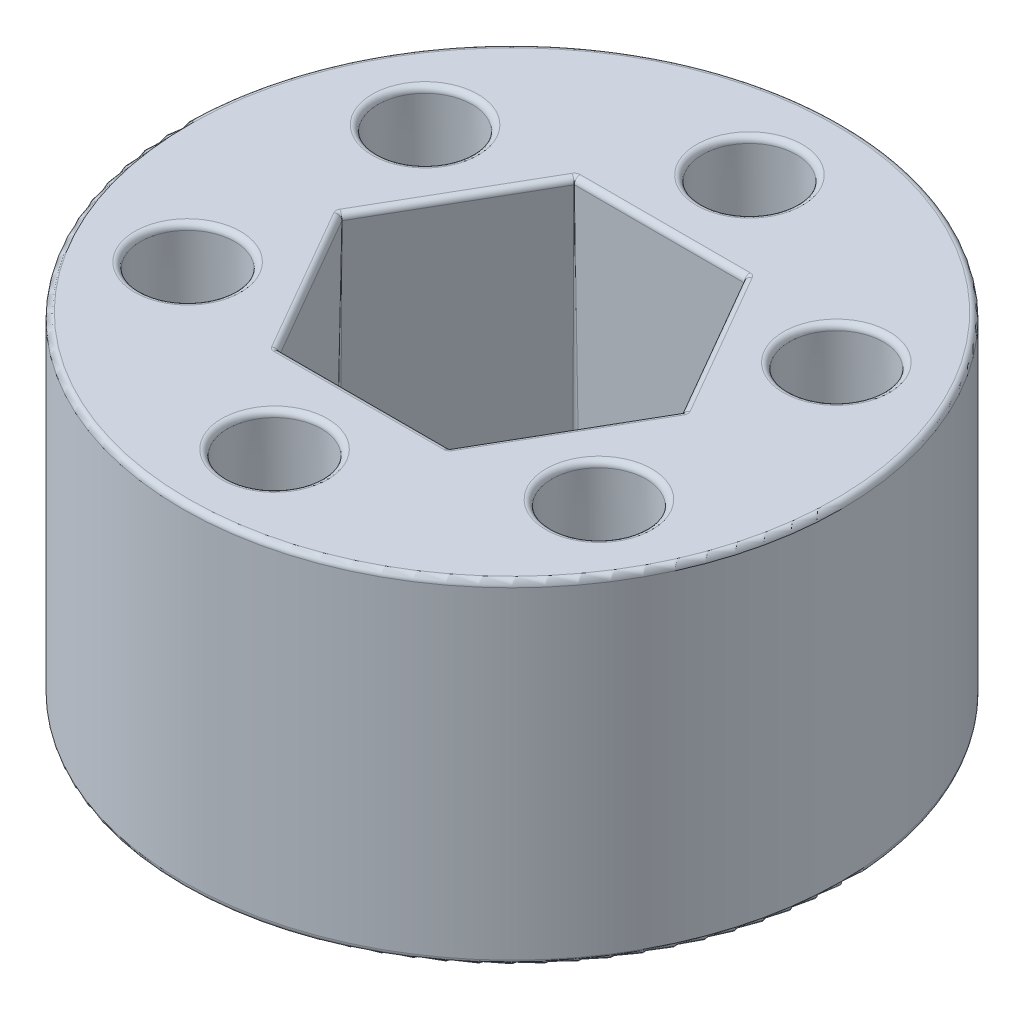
ISO-10303-21;
HEADER;
FILE_DESCRIPTION(('STEP AP214'),'2;1');
FILE_NAME('part.step','',(''),(''),'','','');
FILE_SCHEMA(('AUTOMOTIVE_DESIGN { 1 0 10303 214 1 1 1 1 }'));
ENDSEC;
DATA;
#1=APPLICATION_CONTEXT('core data for automotive mechanical design processes');
#2=APPLICATION_PROTOCOL_DEFINITION('international standard','automotive_design',2000,#1);
#3=PRODUCT_CONTEXT('',#1,'mechanical');
#4=PRODUCT('Part','Part','',(#3));
#5=PRODUCT_RELATED_PRODUCT_CATEGORY('part','',(#4));
#6=PRODUCT_DEFINITION_FORMATION('','',#4);
#7=PRODUCT_DEFINITION_CONTEXT('part definition',#1,'design');
#8=PRODUCT_DEFINITION('design','',#6,#7);
#9=PRODUCT_DEFINITION_SHAPE('','',#8);
#10=(LENGTH_UNIT() NAMED_UNIT(*) SI_UNIT(.MILLI.,.METRE.));
#11=(NAMED_UNIT(*) PLANE_ANGLE_UNIT() SI_UNIT($,.RADIAN.));
#12=(NAMED_UNIT(*) SI_UNIT($,.STERADIAN.) SOLID_ANGLE_UNIT());
#13=UNCERTAINTY_MEASURE_WITH_UNIT(LENGTH_MEASURE(1.E-05),#10,'distance_accuracy_value','');
#14=(GEOMETRIC_REPRESENTATION_CONTEXT(3) GLOBAL_UNCERTAINTY_ASSIGNED_CONTEXT((#13)) GLOBAL_UNIT_ASSIGNED_CONTEXT((#10,
#11,#12)) REPRESENTATION_CONTEXT('',''));
#15=CARTESIAN_POINT('',(0.,0.,0.));
#16=DIRECTION('',(0.,0.,1.));
#17=DIRECTION('',(1.,0.,0.));
#18=AXIS2_PLACEMENT_3D('',#15,#16,#17);
#19=CARTESIAN_POINT('',(-8.90880332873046,14.224,-5.14350000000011));
#20=DIRECTION('',(0.,1.,0.));
#21=DIRECTION('',(0.,0.,1.));
#22=AXIS2_PLACEMENT_3D('',#19,#20,#21);
#23=TOROIDAL_SURFACE('',#22,2.29175784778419,0.254);
#24=CARTESIAN_POINT('',(-8.90880332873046,14.478,-5.14350000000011));
#25=DIRECTION('',(0.,-1.,0.));
#26=DIRECTION('',(0.,0.,1.));
#27=AXIS2_PLACEMENT_3D('',#24,#25,#26);
#28=CIRCLE('',#27,2.29175784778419);
#29=CARTESIAN_POINT('',(-8.90880332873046,14.478,-2.85174215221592));
#30=VERTEX_POINT('',#29);
#31=EDGE_CURVE('E445',#30,#30,#28,.T.);
#32=ORIENTED_EDGE('',*,*,#31,.F.);
#33=EDGE_LOOP('',(#32));
#34=FACE_BOUND('',#33,.T.);
#35=CARTESIAN_POINT('',(-8.90880332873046,14.2195670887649,-5.14350000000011));
#36=DIRECTION('',(0.,1.,0.));
#37=DIRECTION('',(0.,0.,-1.));
#38=AXIS2_PLACEMENT_3D('',#35,#36,#37);
#39=CIRCLE('',#38,2.03779653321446);
#40=CARTESIAN_POINT('',(-8.90880332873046,14.2195670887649,-7.18129653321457));
#41=VERTEX_POINT('',#40);
#42=EDGE_CURVE('E39',#41,#41,#39,.T.);
#43=ORIENTED_EDGE('',*,*,#42,.F.);
#44=EDGE_LOOP('',(#43));
#45=FACE_BOUND('',#44,.T.);
#46=ADVANCED_FACE('F17',(#34,#45),#23,.T.);
#47=CARTESIAN_POINT('',(-8.90880332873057,14.224,5.14349999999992));
#48=DIRECTION('',(0.,1.,0.));
#49=DIRECTION('',(0.,0.,1.));
#50=AXIS2_PLACEMENT_3D('',#47,#48,#49);
#51=TOROIDAL_SURFACE('',#50,2.29175784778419,0.254);
#52=CARTESIAN_POINT('',(-8.90880332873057,14.478,5.14349999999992));
#53=DIRECTION('',(0.,-1.,0.));
#54=DIRECTION('',(0.,0.,1.));
#55=AXIS2_PLACEMENT_3D('',#52,#53,#54);
#56=CIRCLE('',#55,2.29175784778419);
#57=CARTESIAN_POINT('',(-8.90880332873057,14.478,7.4352578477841));
#58=VERTEX_POINT('',#57);
#59=EDGE_CURVE('E448',#58,#58,#56,.T.);
#60=ORIENTED_EDGE('',*,*,#59,.F.);
#61=EDGE_LOOP('',(#60));
#62=FACE_BOUND('',#61,.T.);
#63=CARTESIAN_POINT('',(-8.90880332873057,14.2195670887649,5.14349999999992));
#64=DIRECTION('',(0.,1.,0.));
#65=DIRECTION('',(0.,0.,-1.));
#66=AXIS2_PLACEMENT_3D('',#63,#64,#65);
#67=CIRCLE('',#66,2.03779653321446);
#68=CARTESIAN_POINT('',(-8.90880332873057,14.2195670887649,3.10570346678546));
#69=VERTEX_POINT('',#68);
#70=EDGE_CURVE('E331',#69,#69,#67,.T.);
#71=ORIENTED_EDGE('',*,*,#70,.F.);
#72=EDGE_LOOP('',(#71));
#73=FACE_BOUND('',#72,.T.);
#74=ADVANCED_FACE('F863',(#62,#73),#51,.T.);
#75=CARTESIAN_POINT('',(0.,14.224,10.287));
#76=DIRECTION('',(0.,1.,0.));
#77=DIRECTION('',(0.,0.,1.));
#78=AXIS2_PLACEMENT_3D('',#75,#76,#77);
#79=TOROIDAL_SURFACE('',#78,2.29175784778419,0.254);
#80=CARTESIAN_POINT('',(0.,14.478,10.287));
#81=DIRECTION('',(0.,-1.,0.));
#82=DIRECTION('',(0.,0.,1.));
#83=AXIS2_PLACEMENT_3D('',#80,#81,#82);
#84=CIRCLE('',#83,2.29175784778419);
#85=CARTESIAN_POINT('',(0.,14.478,12.5787578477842));
#86=VERTEX_POINT('',#85);
#87=EDGE_CURVE('E539',#86,#86,#84,.T.);
#88=ORIENTED_EDGE('',*,*,#87,.F.);
#89=EDGE_LOOP('',(#88));
#90=FACE_BOUND('',#89,.T.);
#91=CARTESIAN_POINT('',(0.,14.2195670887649,10.287));
#92=DIRECTION('',(0.,1.,0.));
#93=DIRECTION('',(0.,0.,-1.));
#94=AXIS2_PLACEMENT_3D('',#91,#92,#93);
#95=CIRCLE('',#94,2.03779653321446);
#96=CARTESIAN_POINT('',(0.,14.2195670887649,8.24920346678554));
#97=VERTEX_POINT('',#96);
#98=EDGE_CURVE('E345',#97,#97,#95,.T.);
#99=ORIENTED_EDGE('',*,*,#98,.F.);
#100=EDGE_LOOP('',(#99));
#101=FACE_BOUND('',#100,.T.);
#102=ADVANCED_FACE('F19',(#90,#101),#79,.T.);
#103=CARTESIAN_POINT('',(8.9088033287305,14.224,5.1435));
#104=DIRECTION('',(0.,1.,0.));
#105=DIRECTION('',(0.,0.,1.));
#106=AXIS2_PLACEMENT_3D('',#103,#104,#105);
#107=TOROIDAL_SURFACE('',#106,2.29175784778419,0.254);
#108=CARTESIAN_POINT('',(8.9088033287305,14.478,5.1435));
#109=DIRECTION('',(0.,-1.,0.));
#110=DIRECTION('',(0.,0.,1.));
#111=AXIS2_PLACEMENT_3D('',#108,#109,#110);
#112=CIRCLE('',#111,2.29175784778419);
#113=CARTESIAN_POINT('',(8.9088033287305,14.478,7.43525784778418));
#114=VERTEX_POINT('',#113);
#115=EDGE_CURVE('E535',#114,#114,#112,.T.);
#116=ORIENTED_EDGE('',*,*,#115,.F.);
#117=EDGE_LOOP('',(#116));
#118=FACE_BOUND('',#117,.T.);
#119=CARTESIAN_POINT('',(8.9088033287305,14.2195670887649,5.1435));
#120=DIRECTION('',(0.,1.,0.));
#121=DIRECTION('',(0.,0.,-1.));
#122=AXIS2_PLACEMENT_3D('',#119,#120,#121);
#123=CIRCLE('',#122,2.03779653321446);
#124=CARTESIAN_POINT('',(8.9088033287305,14.2195670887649,3.10570346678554));
#125=VERTEX_POINT('',#124);
#126=EDGE_CURVE('E528',#125,#125,#123,.T.);
#127=ORIENTED_EDGE('',*,*,#126,.F.);
#128=EDGE_LOOP('',(#127));
#129=FACE_BOUND('',#128,.T.);
#130=ADVANCED_FACE('F1286',(#118,#129),#107,.T.);
#131=CARTESIAN_POINT('',(8.90880332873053,14.224,-5.1435));
#132=DIRECTION('',(0.,1.,0.));
#133=DIRECTION('',(0.,0.,1.));
#134=AXIS2_PLACEMENT_3D('',#131,#132,#133);
#135=TOROIDAL_SURFACE('',#134,2.29175784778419,0.254);
#136=CARTESIAN_POINT('',(8.90880332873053,14.478,-5.1435));
#137=DIRECTION('',(0.,-1.,0.));
#138=DIRECTION('',(0.,0.,1.));
#139=AXIS2_PLACEMENT_3D('',#136,#137,#138);
#140=CIRCLE('',#139,2.29175784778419);
#141=CARTESIAN_POINT('',(8.90880332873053,14.478,-2.85174215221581));
#142=VERTEX_POINT('',#141);
#143=EDGE_CURVE('E538',#142,#142,#140,.T.);
#144=ORIENTED_EDGE('',*,*,#143,.F.);
#145=EDGE_LOOP('',(#144));
#146=FACE_BOUND('',#145,.T.);
#147=CARTESIAN_POINT('',(8.90880332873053,14.2195670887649,-5.1435));
#148=DIRECTION('',(0.,1.,0.));
#149=DIRECTION('',(0.,0.,-1.));
#150=AXIS2_PLACEMENT_3D('',#147,#148,#149);
#151=CIRCLE('',#150,2.03779653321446);
#152=CARTESIAN_POINT('',(8.90880332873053,14.2195670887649,-7.18129653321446));
#153=VERTEX_POINT('',#152);
#154=EDGE_CURVE('E589',#153,#153,#151,.T.);
#155=ORIENTED_EDGE('',*,*,#154,.F.);
#156=EDGE_LOOP('',(#155));
#157=FACE_BOUND('',#156,.T.);
#158=ADVANCED_FACE('F859',(#146,#157),#135,.T.);
#159=CARTESIAN_POINT('',(0.,14.224,-10.287));
#160=DIRECTION('',(0.,1.,0.));
#161=DIRECTION('',(0.,0.,1.));
#162=AXIS2_PLACEMENT_3D('',#159,#160,#161);
#163=TOROIDAL_SURFACE('',#162,2.29175784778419,0.254);
#164=CARTESIAN_POINT('',(0.,14.478,-10.287));
#165=DIRECTION('',(0.,-1.,0.));
#166=DIRECTION('',(0.,0.,1.));
#167=AXIS2_PLACEMENT_3D('',#164,#165,#166);
#168=CIRCLE('',#167,2.29175784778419);
#169=CARTESIAN_POINT('',(0.,14.478,-7.99524215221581));
#170=VERTEX_POINT('',#169);
#171=EDGE_CURVE('E398',#170,#170,#168,.T.);
#172=ORIENTED_EDGE('',*,*,#171,.F.);
#173=EDGE_LOOP('',(#172));
#174=FACE_BOUND('',#173,.T.);
#175=CARTESIAN_POINT('',(0.,14.2195670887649,-10.287));
#176=DIRECTION('',(0.,1.,0.));
#177=DIRECTION('',(0.,0.,-1.));
#178=AXIS2_PLACEMENT_3D('',#175,#176,#177);
#179=CIRCLE('',#178,2.03779653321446);
#180=CARTESIAN_POINT('',(0.,14.2195670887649,-12.3247965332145));
#181=VERTEX_POINT('',#180);
#182=EDGE_CURVE('E372',#181,#181,#179,.T.);
#183=ORIENTED_EDGE('',*,*,#182,.F.);
#184=EDGE_LOOP('',(#183));
#185=FACE_BOUND('',#184,.T.);
#186=ADVANCED_FACE('F850',(#174,#185),#163,.T.);
#187=CARTESIAN_POINT('',(7.36167781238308,14.224,0.));
#188=DIRECTION('',(0.,1.,0.));
#189=DIRECTION('',(0.,0.,1.));
#190=AXIS2_PLACEMENT_3D('',#187,#188,#189);
#191=TOROIDAL_SURFACE('',#190,0.259757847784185,0.254);
#192=CARTESIAN_POINT('',(7.58663470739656,14.224,0.12987892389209));
#193=DIRECTION('',(0.5,1.17881583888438E-13,-0.866025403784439));
#194=DIRECTION('',(-0.866025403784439,0.,-0.5));
#195=AXIS2_PLACEMENT_3D('',#192,#193,#194);
#196=CIRCLE('',#195,0.254);
#197=CARTESIAN_POINT('',(7.36669775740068,14.2195670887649,0.00289826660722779));
#198=VERTEX_POINT('',#197);
#199=CARTESIAN_POINT('',(7.58663470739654,14.478,0.129878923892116));
#200=VERTEX_POINT('',#199);
#201=EDGE_CURVE('E11',#198,#200,#196,.T.);
#202=ORIENTED_EDGE('',*,*,#201,.T.);
#203=CARTESIAN_POINT('',(7.36167781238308,14.478,0.));
#204=DIRECTION('',(0.,-1.,0.));
#205=DIRECTION('',(0.,0.,1.));
#206=AXIS2_PLACEMENT_3D('',#203,#204,#205);
#207=CIRCLE('',#206,0.259757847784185);
#208=CARTESIAN_POINT('',(7.58663470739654,14.478,-0.129878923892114));
#209=VERTEX_POINT('',#208);
#210=EDGE_CURVE('E377',#209,#200,#207,.T.);
#211=ORIENTED_EDGE('',*,*,#210,.F.);
#212=CARTESIAN_POINT('',(7.58663470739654,14.224,-0.129878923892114));
#213=DIRECTION('',(0.500000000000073,0.,0.866025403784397));
#214=DIRECTION('',(0.866025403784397,0.,-0.500000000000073));
#215=AXIS2_PLACEMENT_3D('',#212,#213,#214);
#216=CIRCLE('',#215,0.254);
#217=CARTESIAN_POINT('',(7.36669775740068,14.2195670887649,-0.00289826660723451));
#218=VERTEX_POINT('',#217);
#219=EDGE_CURVE('E431',#209,#218,#216,.T.);
#220=ORIENTED_EDGE('',*,*,#219,.T.);
#221=CARTESIAN_POINT('',(7.36167781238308,14.2195670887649,0.));
#222=DIRECTION('',(0.,1.,0.));
#223=DIRECTION('',(-1.49634567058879E-13,0.,-1.));
#224=AXIS2_PLACEMENT_3D('',#221,#222,#223);
#225=CIRCLE('',#224,0.00579653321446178);
#226=EDGE_CURVE('E485',#198,#218,#225,.T.);
#227=ORIENTED_EDGE('',*,*,#226,.F.);
#228=EDGE_LOOP('',(#202,#211,#220,#227));
#229=FACE_BOUND('',#228,.T.);
#230=ADVANCED_FACE('F848',(#229),#191,.T.);
#231=CARTESIAN_POINT('',(3.68083890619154,14.224,6.3754));
#232=DIRECTION('',(0.,1.,0.));
#233=DIRECTION('',(0.,0.,1.));
#234=AXIS2_PLACEMENT_3D('',#231,#232,#233);
#235=TOROIDAL_SURFACE('',#234,0.259757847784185,0.254);
#236=CARTESIAN_POINT('',(3.68083890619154,14.224,6.63515784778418));
#237=DIRECTION('',(1.,0.,0.));
#238=DIRECTION('',(0.,0.,-1.));
#239=AXIS2_PLACEMENT_3D('',#236,#237,#238);
#240=CIRCLE('',#239,0.254);
#241=CARTESIAN_POINT('',(3.68083890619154,14.2195670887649,6.38119653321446));
#242=VERTEX_POINT('',#241);
#243=CARTESIAN_POINT('',(3.68083890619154,14.478,6.63515784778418));
#244=VERTEX_POINT('',#243);
#245=EDGE_CURVE('E434',#242,#244,#240,.T.);
#246=ORIENTED_EDGE('',*,*,#245,.T.);
#247=CARTESIAN_POINT('',(3.68083890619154,14.478,6.3754));
#248=DIRECTION('',(0.,-1.,0.));
#249=DIRECTION('',(0.,0.,1.));
#250=AXIS2_PLACEMENT_3D('',#247,#248,#249);
#251=CIRCLE('',#250,0.259757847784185);
#252=CARTESIAN_POINT('',(3.90579580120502,14.478,6.50527892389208));
#253=VERTEX_POINT('',#252);
#254=EDGE_CURVE('E556',#253,#244,#251,.T.);
#255=ORIENTED_EDGE('',*,*,#254,.F.);
#256=CARTESIAN_POINT('',(3.90579580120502,14.224,6.50527892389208));
#257=DIRECTION('',(0.49999999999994,0.,-0.866025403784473));
#258=DIRECTION('',(-0.866025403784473,0.,-0.49999999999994));
#259=AXIS2_PLACEMENT_3D('',#256,#257,#258);
#260=CIRCLE('',#259,0.254);
#261=CARTESIAN_POINT('',(3.68585885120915,14.2195670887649,6.37829826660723));
#262=VERTEX_POINT('',#261);
#263=EDGE_CURVE('E28',#262,#253,#260,.T.);
#264=ORIENTED_EDGE('',*,*,#263,.F.);
#265=CARTESIAN_POINT('',(3.68083890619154,14.2195670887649,6.3754));
#266=DIRECTION('',(0.,1.,0.));
#267=DIRECTION('',(0.,0.,-1.));
#268=AXIS2_PLACEMENT_3D('',#265,#266,#267);
#269=CIRCLE('',#268,0.00579653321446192);
#270=EDGE_CURVE('E477',#242,#262,#269,.T.);
#271=ORIENTED_EDGE('',*,*,#270,.F.);
#272=EDGE_LOOP('',(#246,#255,#264,#271));
#273=FACE_BOUND('',#272,.T.);
#274=ADVANCED_FACE('F610',(#273),#235,.T.);
#275=CARTESIAN_POINT('',(3.68083890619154,14.224,-6.3754));
#276=DIRECTION('',(0.,1.,0.));
#277=DIRECTION('',(0.,0.,1.));
#278=AXIS2_PLACEMENT_3D('',#275,#276,#277);
#279=TOROIDAL_SURFACE('',#278,0.259757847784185,0.254);
#280=CARTESIAN_POINT('',(3.90579580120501,14.224,-6.50527892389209));
#281=DIRECTION('',(0.5,0.,0.866025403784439));
#282=DIRECTION('',(0.866025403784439,0.,-0.5));
#283=AXIS2_PLACEMENT_3D('',#280,#281,#282);
#284=CIRCLE('',#283,0.254);
#285=CARTESIAN_POINT('',(3.90579580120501,14.478,-6.50527892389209));
#286=VERTEX_POINT('',#285);
#287=CARTESIAN_POINT('',(3.68585885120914,14.2195670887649,-6.37829826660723));
#288=VERTEX_POINT('',#287);
#289=EDGE_CURVE('E21',#286,#288,#284,.T.);
#290=ORIENTED_EDGE('',*,*,#289,.F.);
#291=CARTESIAN_POINT('',(3.68083890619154,14.478,-6.3754));
#292=DIRECTION('',(0.,-1.,0.));
#293=DIRECTION('',(0.,0.,1.));
#294=AXIS2_PLACEMENT_3D('',#291,#292,#293);
#295=CIRCLE('',#294,0.259757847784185);
#296=CARTESIAN_POINT('',(3.68083890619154,14.478,-6.63515784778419));
#297=VERTEX_POINT('',#296);
#298=EDGE_CURVE('E557',#297,#286,#295,.T.);
#299=ORIENTED_EDGE('',*,*,#298,.F.);
#300=CARTESIAN_POINT('',(3.68083890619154,14.224,-6.63515784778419));
#301=DIRECTION('',(1.,0.,0.));
#302=DIRECTION('',(0.,0.,-1.));
#303=AXIS2_PLACEMENT_3D('',#300,#301,#302);
#304=CIRCLE('',#303,0.254);
#305=CARTESIAN_POINT('',(3.68083890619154,14.2195670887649,-6.38119653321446));
#306=VERTEX_POINT('',#305);
#307=EDGE_CURVE('E575',#297,#306,#304,.T.);
#308=ORIENTED_EDGE('',*,*,#307,.T.);
#309=CARTESIAN_POINT('',(3.68083890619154,14.2195670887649,-6.3754));
#310=DIRECTION('',(0.,1.,0.));
#311=DIRECTION('',(4.48903701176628E-13,0.,-1.));
#312=AXIS2_PLACEMENT_3D('',#309,#310,#311);
#313=CIRCLE('',#312,0.00579653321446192);
#314=EDGE_CURVE('E464',#288,#306,#313,.T.);
#315=ORIENTED_EDGE('',*,*,#314,.F.);
#316=EDGE_LOOP('',(#290,#299,#308,#315));
#317=FACE_BOUND('',#316,.T.);
#318=ADVANCED_FACE('F825',(#317),#279,.T.);
#319=CARTESIAN_POINT('',(-3.68083890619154,14.224,6.3754));
#320=DIRECTION('',(0.,1.,0.));
#321=DIRECTION('',(0.,0.,1.));
#322=AXIS2_PLACEMENT_3D('',#319,#320,#321);
#323=TOROIDAL_SURFACE('',#322,0.259757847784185,0.254);
#324=CARTESIAN_POINT('',(-3.90579580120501,14.224,6.50527892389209));
#325=DIRECTION('',(0.5,0.,0.866025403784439));
#326=DIRECTION('',(0.866025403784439,0.,-0.5));
#327=AXIS2_PLACEMENT_3D('',#324,#325,#326);
#328=CIRCLE('',#327,0.254);
#329=CARTESIAN_POINT('',(-3.68585885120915,14.2195670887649,6.37829826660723));
#330=VERTEX_POINT('',#329);
#331=CARTESIAN_POINT('',(-3.90579580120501,14.478,6.50527892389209));
#332=VERTEX_POINT('',#331);
#333=EDGE_CURVE('E438',#330,#332,#328,.T.);
#334=ORIENTED_EDGE('',*,*,#333,.T.);
#335=CARTESIAN_POINT('',(-3.68083890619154,14.478,6.3754));
#336=DIRECTION('',(0.,-1.,0.));
#337=DIRECTION('',(0.,0.,1.));
#338=AXIS2_PLACEMENT_3D('',#335,#336,#337);
#339=CIRCLE('',#338,0.259757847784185);
#340=CARTESIAN_POINT('',(-3.68083890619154,14.478,6.63515784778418));
#341=VERTEX_POINT('',#340);
#342=EDGE_CURVE('E571',#341,#332,#339,.T.);
#343=ORIENTED_EDGE('',*,*,#342,.F.);
#344=CARTESIAN_POINT('',(-3.68083890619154,14.224,6.63515784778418));
#345=DIRECTION('',(1.,0.,0.));
#346=DIRECTION('',(0.,0.,-1.));
#347=AXIS2_PLACEMENT_3D('',#344,#345,#346);
#348=CIRCLE('',#347,0.254);
#349=CARTESIAN_POINT('',(-3.68083890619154,14.2195670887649,6.38119653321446));
#350=VERTEX_POINT('',#349);
#351=EDGE_CURVE('E601',#350,#341,#348,.T.);
#352=ORIENTED_EDGE('',*,*,#351,.F.);
#353=CARTESIAN_POINT('',(-3.68083890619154,14.2195670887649,6.3754));
#354=DIRECTION('',(0.,1.,0.));
#355=DIRECTION('',(0.,0.,-1.));
#356=AXIS2_PLACEMENT_3D('',#353,#354,#355);
#357=CIRCLE('',#356,0.00579653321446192);
#358=EDGE_CURVE('E468',#330,#350,#357,.T.);
#359=ORIENTED_EDGE('',*,*,#358,.F.);
#360=EDGE_LOOP('',(#334,#343,#352,#359));
#361=FACE_BOUND('',#360,.T.);
#362=ADVANCED_FACE('F796',(#361),#323,.T.);
#363=CARTESIAN_POINT('',(-3.68083890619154,14.224,-6.3754));
#364=DIRECTION('',(0.,1.,0.));
#365=DIRECTION('',(0.,0.,1.));
#366=AXIS2_PLACEMENT_3D('',#363,#364,#365);
#367=TOROIDAL_SURFACE('',#366,0.259757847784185,0.254);
#368=CARTESIAN_POINT('',(-3.68083890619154,14.224,-6.63515784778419));
#369=DIRECTION('',(1.,0.,0.));
#370=DIRECTION('',(0.,0.,-1.));
#371=AXIS2_PLACEMENT_3D('',#368,#369,#370);
#372=CIRCLE('',#371,0.254);
#373=CARTESIAN_POINT('',(-3.68083890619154,14.478,-6.63515784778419));
#374=VERTEX_POINT('',#373);
#375=CARTESIAN_POINT('',(-3.68083890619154,14.2195670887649,-6.38119653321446));
#376=VERTEX_POINT('',#375);
#377=EDGE_CURVE('E578',#374,#376,#372,.T.);
#378=ORIENTED_EDGE('',*,*,#377,.F.);
#379=CARTESIAN_POINT('',(-3.68083890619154,14.478,-6.3754));
#380=DIRECTION('',(0.,-1.,0.));
#381=DIRECTION('',(0.,0.,1.));
#382=AXIS2_PLACEMENT_3D('',#379,#380,#381);
#383=CIRCLE('',#382,0.259757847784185);
#384=CARTESIAN_POINT('',(-3.905795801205,14.478,-6.50527892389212));
#385=VERTEX_POINT('',#384);
#386=EDGE_CURVE('E493',#385,#374,#383,.T.);
#387=ORIENTED_EDGE('',*,*,#386,.F.);
#388=CARTESIAN_POINT('',(-3.905795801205,14.224,-6.50527892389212));
#389=DIRECTION('',(0.500000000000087,0.,-0.866025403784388));
#390=DIRECTION('',(-0.866025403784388,0.,-0.500000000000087));
#391=AXIS2_PLACEMENT_3D('',#388,#389,#390);
#392=CIRCLE('',#391,0.254);
#393=CARTESIAN_POINT('',(-3.68585885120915,14.2195670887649,-6.37829826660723));
#394=VERTEX_POINT('',#393);
#395=EDGE_CURVE('E596',#385,#394,#392,.T.);
#396=ORIENTED_EDGE('',*,*,#395,.T.);
#397=CARTESIAN_POINT('',(-3.68083890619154,14.2195670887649,-6.3754));
#398=DIRECTION('',(0.,1.,0.));
#399=DIRECTION('',(0.,0.,-1.));
#400=AXIS2_PLACEMENT_3D('',#397,#398,#399);
#401=CIRCLE('',#400,0.00579653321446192);
#402=EDGE_CURVE('E422',#376,#394,#401,.T.);
#403=ORIENTED_EDGE('',*,*,#402,.F.);
#404=EDGE_LOOP('',(#378,#387,#396,#403));
#405=FACE_BOUND('',#404,.T.);
#406=ADVANCED_FACE('F814',(#405),#367,.T.);
#407=CARTESIAN_POINT('',(-7.36167781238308,14.224,0.));
#408=DIRECTION('',(0.,1.,0.));
#409=DIRECTION('',(0.,0.,1.));
#410=AXIS2_PLACEMENT_3D('',#407,#408,#409);
#411=TOROIDAL_SURFACE('',#410,0.259757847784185,0.254);
#412=CARTESIAN_POINT('',(-7.58663470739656,14.224,-0.129878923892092));
#413=DIRECTION('',(0.5,0.,-0.866025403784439));
#414=DIRECTION('',(-0.866025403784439,0.,-0.5));
#415=AXIS2_PLACEMENT_3D('',#412,#413,#414);
#416=CIRCLE('',#415,0.254);
#417=CARTESIAN_POINT('',(-7.58663470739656,14.478,-0.129878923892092));
#418=VERTEX_POINT('',#417);
#419=CARTESIAN_POINT('',(-7.36669775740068,14.2195670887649,-0.00289826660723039));
#420=VERTEX_POINT('',#419);
#421=EDGE_CURVE('E439',#418,#420,#416,.T.);
#422=ORIENTED_EDGE('',*,*,#421,.F.);
#423=CARTESIAN_POINT('',(-7.36167781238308,14.478,0.));
#424=DIRECTION('',(0.,-1.,0.));
#425=DIRECTION('',(0.,0.,1.));
#426=AXIS2_PLACEMENT_3D('',#423,#424,#425);
#427=CIRCLE('',#426,0.259757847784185);
#428=CARTESIAN_POINT('',(-7.58663470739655,14.478,0.129878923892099));
#429=VERTEX_POINT('',#428);
#430=EDGE_CURVE('E494',#429,#418,#427,.T.);
#431=ORIENTED_EDGE('',*,*,#430,.F.);
#432=CARTESIAN_POINT('',(-7.58663470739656,14.224,0.129878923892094));
#433=DIRECTION('',(0.500000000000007,0.,0.866025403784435));
#434=DIRECTION('',(0.866025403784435,0.,-0.500000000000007));
#435=AXIS2_PLACEMENT_3D('',#432,#433,#434);
#436=CIRCLE('',#435,0.254);
#437=CARTESIAN_POINT('',(-7.36669775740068,14.2195670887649,0.00289826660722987));
#438=VERTEX_POINT('',#437);
#439=EDGE_CURVE('E435',#438,#429,#436,.T.);
#440=ORIENTED_EDGE('',*,*,#439,.F.);
#441=CARTESIAN_POINT('',(-7.36167781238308,14.2195670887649,0.));
#442=DIRECTION('',(0.,1.,0.));
#443=DIRECTION('',(1.49634567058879E-13,0.,-1.));
#444=AXIS2_PLACEMENT_3D('',#441,#442,#443);
#445=CIRCLE('',#444,0.00579653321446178);
#446=EDGE_CURVE('E452',#420,#438,#445,.T.);
#447=ORIENTED_EDGE('',*,*,#446,.F.);
#448=EDGE_LOOP('',(#422,#431,#440,#447));
#449=FACE_BOUND('',#448,.T.);
#450=ADVANCED_FACE('F726',(#449),#411,.T.);
#451=CARTESIAN_POINT('',(0.,14.224,0.));
#452=DIRECTION('',(0.,1.,0.));
#453=DIRECTION('',(0.,0.,1.));
#454=AXIS2_PLACEMENT_3D('',#451,#452,#453);
#455=TOROIDAL_SURFACE('',#454,14.0208,0.254);
#456=CARTESIAN_POINT('',(0.,14.224,0.));
#457=DIRECTION('',(0.,-1.,0.));
#458=DIRECTION('',(0.,0.,1.));
#459=AXIS2_PLACEMENT_3D('',#456,#457,#458);
#460=CIRCLE('',#459,14.2748);
#461=CARTESIAN_POINT('',(0.,14.224,14.2748));
#462=VERTEX_POINT('',#461);
#463=EDGE_CURVE('E584',#462,#462,#460,.T.);
#464=ORIENTED_EDGE('',*,*,#463,.F.);
#465=EDGE_LOOP('',(#464));
#466=FACE_BOUND('',#465,.T.);
#467=CARTESIAN_POINT('',(0.,14.478,0.));
#468=DIRECTION('',(0.,1.,0.));
#469=DIRECTION('',(0.,0.,1.));
#470=AXIS2_PLACEMENT_3D('',#467,#468,#469);
#471=CIRCLE('',#470,14.0208);
#472=CARTESIAN_POINT('',(0.,14.478,14.0208));
#473=VERTEX_POINT('',#472);
#474=EDGE_CURVE('E395',#473,#473,#471,.T.);
#475=ORIENTED_EDGE('',*,*,#474,.F.);
#476=EDGE_LOOP('',(#475));
#477=FACE_BOUND('',#476,.T.);
#478=ADVANCED_FACE('F904',(#466,#477),#455,.T.);
#479=CARTESIAN_POINT('',(3.83247231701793,14.224,6.63227892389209));
#480=DIRECTION('',(0.5,0.,-0.866025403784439));
#481=DIRECTION('',(-0.866025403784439,0.,-0.5));
#482=AXIS2_PLACEMENT_3D('',#479,#480,#481);
#483=CYLINDRICAL_SURFACE('',#482,0.254);
#484=ORIENTED_EDGE('',*,*,#263,.T.);
#485=DIRECTION('',(-0.5,0.,0.866025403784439));
#486=VECTOR('',#485,1.);
#487=CARTESIAN_POINT('',(5.74621525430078,14.478,3.31757892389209));
#488=LINE('',#487,#486);
#489=EDGE_CURVE('E381',#200,#253,#488,.T.);
#490=ORIENTED_EDGE('',*,*,#489,.F.);
#491=ORIENTED_EDGE('',*,*,#201,.F.);
#492=DIRECTION('',(0.5,0.,-0.866025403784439));
#493=VECTOR('',#492,1.);
#494=CARTESIAN_POINT('',(3.61253536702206,14.2195670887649,6.50529826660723));
#495=LINE('',#494,#493);
#496=EDGE_CURVE('E362',#262,#198,#495,.T.);
#497=ORIENTED_EDGE('',*,*,#496,.F.);
#498=EDGE_LOOP('',(#484,#490,#491,#497));
#499=FACE_BOUND('',#498,.T.);
#500=ADVANCED_FACE('F627',(#499),#483,.T.);
#501=CARTESIAN_POINT('',(7.65995819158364,14.224,-0.00287892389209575));
#502=DIRECTION('',(-0.5,0.,-0.866025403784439));
#503=DIRECTION('',(-0.866025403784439,0.,0.5));
#504=AXIS2_PLACEMENT_3D('',#501,#502,#503);
#505=CYLINDRICAL_SURFACE('',#504,0.254);
#506=ORIENTED_EDGE('',*,*,#219,.F.);
#507=DIRECTION('',(0.5,0.,0.866025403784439));
#508=VECTOR('',#507,1.);
#509=CARTESIAN_POINT('',(5.74621525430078,14.478,-3.3175789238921));
#510=LINE('',#509,#508);
#511=EDGE_CURVE('E382',#286,#209,#510,.T.);
#512=ORIENTED_EDGE('',*,*,#511,.F.);
#513=ORIENTED_EDGE('',*,*,#289,.T.);
#514=DIRECTION('',(-0.5,0.,-0.866025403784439));
#515=VECTOR('',#514,1.);
#516=CARTESIAN_POINT('',(7.44002124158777,14.2195670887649,0.124101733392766));
#517=LINE('',#516,#515);
#518=EDGE_CURVE('E367',#218,#288,#517,.T.);
#519=ORIENTED_EDGE('',*,*,#518,.F.);
#520=EDGE_LOOP('',(#506,#512,#513,#519));
#521=FACE_BOUND('',#520,.T.);
#522=ADVANCED_FACE('F829',(#521),#505,.T.);
#523=CARTESIAN_POINT('',(-3.8274858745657,14.224,6.63515784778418));
#524=DIRECTION('',(1.,0.,0.));
#525=DIRECTION('',(0.,0.,-1.));
#526=AXIS2_PLACEMENT_3D('',#523,#524,#525);
#527=CYLINDRICAL_SURFACE('',#526,0.254);
#528=ORIENTED_EDGE('',*,*,#351,.T.);
#529=DIRECTION('',(-1.,0.,0.));
#530=VECTOR('',#529,1.);
#531=CARTESIAN_POINT('',(0.,14.478,6.63515784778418));
#532=LINE('',#531,#530);
#533=EDGE_CURVE('E566',#244,#341,#532,.T.);
#534=ORIENTED_EDGE('',*,*,#533,.F.);
#535=ORIENTED_EDGE('',*,*,#245,.F.);
#536=DIRECTION('',(1.,0.,0.));
#537=VECTOR('',#536,1.);
#538=CARTESIAN_POINT('',(-3.8274858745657,14.2195670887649,6.38119653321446));
#539=LINE('',#538,#537);
#540=EDGE_CURVE('E366',#350,#242,#539,.T.);
#541=ORIENTED_EDGE('',*,*,#540,.F.);
#542=EDGE_LOOP('',(#528,#534,#535,#541));
#543=FACE_BOUND('',#542,.T.);
#544=ADVANCED_FACE('F615',(#543),#527,.T.);
#545=CARTESIAN_POINT('',(3.8274858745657,14.224,-6.63515784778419));
#546=DIRECTION('',(-1.,0.,0.));
#547=DIRECTION('',(0.,0.,1.));
#548=AXIS2_PLACEMENT_3D('',#545,#546,#547);
#549=CYLINDRICAL_SURFACE('',#548,0.254);
#550=ORIENTED_EDGE('',*,*,#307,.F.);
#551=DIRECTION('',(1.,0.,0.));
#552=VECTOR('',#551,1.);
#553=CARTESIAN_POINT('',(0.,14.478,-6.63515784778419));
#554=LINE('',#553,#552);
#555=EDGE_CURVE('E562',#374,#297,#554,.T.);
#556=ORIENTED_EDGE('',*,*,#555,.F.);
#557=ORIENTED_EDGE('',*,*,#377,.T.);
#558=DIRECTION('',(-1.,0.,0.));
#559=VECTOR('',#558,1.);
#560=CARTESIAN_POINT('',(3.8274858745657,14.2195670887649,-6.38119653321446));
#561=LINE('',#560,#559);
#562=EDGE_CURVE('E506',#306,#376,#561,.T.);
#563=ORIENTED_EDGE('',*,*,#562,.F.);
#564=EDGE_LOOP('',(#550,#556,#557,#563));
#565=FACE_BOUND('',#564,.T.);
#566=ADVANCED_FACE('F821',(#565),#549,.T.);
#567=CARTESIAN_POINT('',(-7.65995819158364,14.224,0.00287892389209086));
#568=DIRECTION('',(0.5,0.,0.866025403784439));
#569=DIRECTION('',(0.866025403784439,0.,-0.5));
#570=AXIS2_PLACEMENT_3D('',#567,#568,#569);
#571=CYLINDRICAL_SURFACE('',#570,0.254);
#572=ORIENTED_EDGE('',*,*,#439,.T.);
#573=DIRECTION('',(-0.5,0.,-0.866025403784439));
#574=VECTOR('',#573,1.);
#575=CARTESIAN_POINT('',(-5.74621525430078,14.478,3.3175789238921));
#576=LINE('',#575,#574);
#577=EDGE_CURVE('E567',#332,#429,#576,.T.);
#578=ORIENTED_EDGE('',*,*,#577,.F.);
#579=ORIENTED_EDGE('',*,*,#333,.F.);
#580=DIRECTION('',(0.5,0.,0.866025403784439));
#581=VECTOR('',#580,1.);
#582=CARTESIAN_POINT('',(-7.44002124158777,14.2195670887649,-0.124101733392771));
#583=LINE('',#582,#581);
#584=EDGE_CURVE('E495',#438,#330,#583,.T.);
#585=ORIENTED_EDGE('',*,*,#584,.F.);
#586=EDGE_LOOP('',(#572,#578,#579,#585));
#587=FACE_BOUND('',#586,.T.);
#588=ADVANCED_FACE('F799',(#587),#571,.T.);
#589=CARTESIAN_POINT('',(-3.83247231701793,14.224,-6.63227892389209));
#590=DIRECTION('',(-0.5,0.,0.866025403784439));
#591=DIRECTION('',(0.866025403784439,0.,0.5));
#592=AXIS2_PLACEMENT_3D('',#589,#590,#591);
#593=CYLINDRICAL_SURFACE('',#592,0.254);
#594=ORIENTED_EDGE('',*,*,#395,.F.);
#595=DIRECTION('',(0.5,0.,-0.866025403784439));
#596=VECTOR('',#595,1.);
#597=CARTESIAN_POINT('',(-5.74621525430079,14.478,-3.3175789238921));
#598=LINE('',#597,#596);
#599=EDGE_CURVE('E489',#418,#385,#598,.T.);
#600=ORIENTED_EDGE('',*,*,#599,.F.);
#601=ORIENTED_EDGE('',*,*,#421,.T.);
#602=DIRECTION('',(-0.5,0.,0.866025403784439));
#603=VECTOR('',#602,1.);
#604=CARTESIAN_POINT('',(-3.61253536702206,14.2195670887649,-6.50529826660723));
#605=LINE('',#604,#603);
#606=EDGE_CURVE('E499',#394,#420,#605,.T.);
#607=ORIENTED_EDGE('',*,*,#606,.F.);
#608=EDGE_LOOP('',(#594,#600,#601,#607));
#609=FACE_BOUND('',#608,.T.);
#610=ADVANCED_FACE('F817',(#609),#593,.T.);
#611=CARTESIAN_POINT('',(-8.90880332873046,0.254,-5.14350000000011));
#612=DIRECTION('',(0.,1.,0.));
#613=DIRECTION('',(0.,0.,1.));
#614=AXIS2_PLACEMENT_3D('',#611,#612,#613);
#615=TOROIDAL_SURFACE('',#614,2.53560510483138,0.254);
#616=CARTESIAN_POINT('',(-8.90880332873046,0.249567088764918,-5.14350000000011));
#617=DIRECTION('',(0.,-1.,0.));
#618=DIRECTION('',(0.,0.,1.));
#619=AXIS2_PLACEMENT_3D('',#616,#617,#618);
#620=CIRCLE('',#619,2.28164379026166);
#621=CARTESIAN_POINT('',(-8.90880332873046,0.249567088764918,-2.86185620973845));
#622=VERTEX_POINT('',#621);
#623=EDGE_CURVE('E336',#622,#622,#620,.T.);
#624=ORIENTED_EDGE('',*,*,#623,.F.);
#625=EDGE_LOOP('',(#624));
#626=FACE_BOUND('',#625,.T.);
#627=CARTESIAN_POINT('',(-8.90880332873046,0.,-5.14350000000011));
#628=DIRECTION('',(0.,1.,0.));
#629=DIRECTION('',(0.,0.,1.));
#630=AXIS2_PLACEMENT_3D('',#627,#628,#629);
#631=CIRCLE('',#630,2.53560510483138);
#632=CARTESIAN_POINT('',(-8.90880332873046,0.,-2.60789489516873));
#633=VERTEX_POINT('',#632);
#634=EDGE_CURVE('E516',#633,#633,#631,.T.);
#635=ORIENTED_EDGE('',*,*,#634,.F.);
#636=EDGE_LOOP('',(#635));
#637=FACE_BOUND('',#636,.T.);
#638=ADVANCED_FACE('F893',(#626,#637),#615,.T.);
#639=CARTESIAN_POINT('',(-8.90880332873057,0.254,5.14349999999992));
#640=DIRECTION('',(0.,1.,0.));
#641=DIRECTION('',(0.,0.,1.));
#642=AXIS2_PLACEMENT_3D('',#639,#640,#641);
#643=TOROIDAL_SURFACE('',#642,2.53560510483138,0.254);
#644=CARTESIAN_POINT('',(-8.90880332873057,0.24956708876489,5.14349999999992));
#645=DIRECTION('',(0.,-1.,0.));
#646=DIRECTION('',(0.,0.,1.));
#647=AXIS2_PLACEMENT_3D('',#644,#645,#646);
#648=CIRCLE('',#647,2.28164379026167);
#649=CARTESIAN_POINT('',(-8.90880332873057,0.24956708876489,7.42514379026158));
#650=VERTEX_POINT('',#649);
#651=EDGE_CURVE('E337',#650,#650,#648,.T.);
#652=ORIENTED_EDGE('',*,*,#651,.F.);
#653=EDGE_LOOP('',(#652));
#654=FACE_BOUND('',#653,.T.);
#655=CARTESIAN_POINT('',(-8.90880332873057,0.,5.14349999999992));
#656=DIRECTION('',(0.,1.,0.));
#657=DIRECTION('',(0.,0.,1.));
#658=AXIS2_PLACEMENT_3D('',#655,#656,#657);
#659=CIRCLE('',#658,2.53560510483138);
#660=CARTESIAN_POINT('',(-8.90880332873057,0.,7.6791051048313));
#661=VERTEX_POINT('',#660);
#662=EDGE_CURVE('E521',#661,#661,#659,.T.);
#663=ORIENTED_EDGE('',*,*,#662,.F.);
#664=EDGE_LOOP('',(#663));
#665=FACE_BOUND('',#664,.T.);
#666=ADVANCED_FACE('F889',(#654,#665),#643,.T.);
#667=CARTESIAN_POINT('',(0.,0.254,10.287));
#668=DIRECTION('',(0.,1.,0.));
#669=DIRECTION('',(0.,0.,1.));
#670=AXIS2_PLACEMENT_3D('',#667,#668,#669);
#671=TOROIDAL_SURFACE('',#670,2.53560510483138,0.254);
#672=CARTESIAN_POINT('',(0.,0.24956708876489,10.287));
#673=DIRECTION('',(0.,-1.,0.));
#674=DIRECTION('',(0.,0.,1.));
#675=AXIS2_PLACEMENT_3D('',#672,#673,#674);
#676=CIRCLE('',#675,2.28164379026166);
#677=CARTESIAN_POINT('',(0.,0.24956708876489,12.5686437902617));
#678=VERTEX_POINT('',#677);
#679=EDGE_CURVE('E414',#678,#678,#676,.T.);
#680=ORIENTED_EDGE('',*,*,#679,.F.);
#681=EDGE_LOOP('',(#680));
#682=FACE_BOUND('',#681,.T.);
#683=CARTESIAN_POINT('',(0.,0.,10.287));
#684=DIRECTION('',(0.,1.,0.));
#685=DIRECTION('',(0.,0.,1.));
#686=AXIS2_PLACEMENT_3D('',#683,#684,#685);
#687=CIRCLE('',#686,2.53560510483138);
#688=CARTESIAN_POINT('',(0.,0.,12.8226051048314));
#689=VERTEX_POINT('',#688);
#690=EDGE_CURVE('E517',#689,#689,#687,.T.);
#691=ORIENTED_EDGE('',*,*,#690,.F.);
#692=EDGE_LOOP('',(#691));
#693=FACE_BOUND('',#692,.T.);
#694=ADVANCED_FACE('F885',(#682,#693),#671,.T.);
#695=CARTESIAN_POINT('',(8.9088033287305,0.254,5.1435));
#696=DIRECTION('',(0.,1.,0.));
#697=DIRECTION('',(0.,0.,1.));
#698=AXIS2_PLACEMENT_3D('',#695,#696,#697);
#699=TOROIDAL_SURFACE('',#698,2.53560510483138,0.254);
#700=CARTESIAN_POINT('',(8.9088033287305,0.24956708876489,5.1435));
#701=DIRECTION('',(0.,-1.,0.));
#702=DIRECTION('',(0.,0.,1.));
#703=AXIS2_PLACEMENT_3D('',#700,#701,#702);
#704=CIRCLE('',#703,2.28164379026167);
#705=CARTESIAN_POINT('',(8.9088033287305,0.24956708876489,7.42514379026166));
#706=VERTEX_POINT('',#705);
#707=EDGE_CURVE('E552',#706,#706,#704,.T.);
#708=ORIENTED_EDGE('',*,*,#707,.F.);
#709=EDGE_LOOP('',(#708));
#710=FACE_BOUND('',#709,.T.);
#711=CARTESIAN_POINT('',(8.9088033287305,0.,5.1435));
#712=DIRECTION('',(0.,1.,0.));
#713=DIRECTION('',(0.,0.,1.));
#714=AXIS2_PLACEMENT_3D('',#711,#712,#713);
#715=CIRCLE('',#714,2.53560510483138);
#716=CARTESIAN_POINT('',(8.9088033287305,0.,7.67910510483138));
#717=VERTEX_POINT('',#716);
#718=EDGE_CURVE('E520',#717,#717,#715,.T.);
#719=ORIENTED_EDGE('',*,*,#718,.F.);
#720=EDGE_LOOP('',(#719));
#721=FACE_BOUND('',#720,.T.);
#722=ADVANCED_FACE('F881',(#710,#721),#699,.T.);
#723=CARTESIAN_POINT('',(8.90880332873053,0.254,-5.1435));
#724=DIRECTION('',(0.,1.,0.));
#725=DIRECTION('',(0.,0.,1.));
#726=AXIS2_PLACEMENT_3D('',#723,#724,#725);
#727=TOROIDAL_SURFACE('',#726,2.53560510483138,0.254);
#728=CARTESIAN_POINT('',(8.90880332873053,0.24956708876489,-5.1435));
#729=DIRECTION('',(0.,-1.,0.));
#730=DIRECTION('',(0.,0.,1.));
#731=AXIS2_PLACEMENT_3D('',#728,#729,#730);
#732=CIRCLE('',#731,2.28164379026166);
#733=CARTESIAN_POINT('',(8.90880332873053,0.24956708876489,-2.86185620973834));
#734=VERTEX_POINT('',#733);
#735=EDGE_CURVE('E375',#734,#734,#732,.T.);
#736=ORIENTED_EDGE('',*,*,#735,.F.);
#737=EDGE_LOOP('',(#736));
#738=FACE_BOUND('',#737,.T.);
#739=CARTESIAN_POINT('',(8.90880332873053,0.,-5.1435));
#740=DIRECTION('',(0.,1.,0.));
#741=DIRECTION('',(0.,0.,1.));
#742=AXIS2_PLACEMENT_3D('',#739,#740,#741);
#743=CIRCLE('',#742,2.53560510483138);
#744=CARTESIAN_POINT('',(8.90880332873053,0.,-2.60789489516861));
#745=VERTEX_POINT('',#744);
#746=EDGE_CURVE('E531',#745,#745,#743,.T.);
#747=ORIENTED_EDGE('',*,*,#746,.F.);
#748=EDGE_LOOP('',(#747));
#749=FACE_BOUND('',#748,.T.);
#750=ADVANCED_FACE('F878',(#738,#749),#727,.T.);
#751=CARTESIAN_POINT('',(0.,0.254,-10.287));
#752=DIRECTION('',(0.,1.,0.));
#753=DIRECTION('',(0.,0.,1.));
#754=AXIS2_PLACEMENT_3D('',#751,#752,#753);
#755=TOROIDAL_SURFACE('',#754,2.53560510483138,0.254);
#756=CARTESIAN_POINT('',(0.,0.24956708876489,-10.287));
#757=DIRECTION('',(0.,-1.,0.));
#758=DIRECTION('',(0.,0.,1.));
#759=AXIS2_PLACEMENT_3D('',#756,#757,#758);
#760=CIRCLE('',#759,2.28164379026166);
#761=CARTESIAN_POINT('',(0.,0.24956708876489,-8.00535620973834));
#762=VERTEX_POINT('',#761);
#763=EDGE_CURVE('E376',#762,#762,#760,.T.);
#764=ORIENTED_EDGE('',*,*,#763,.F.);
#765=EDGE_LOOP('',(#764));
#766=FACE_BOUND('',#765,.T.);
#767=CARTESIAN_POINT('',(0.,0.,-10.287));
#768=DIRECTION('',(0.,1.,0.));
#769=DIRECTION('',(0.,0.,1.));
#770=AXIS2_PLACEMENT_3D('',#767,#768,#769);
#771=CIRCLE('',#770,2.53560510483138);
#772=CARTESIAN_POINT('',(0.,0.,-7.75139489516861));
#773=VERTEX_POINT('',#772);
#774=EDGE_CURVE('E534',#773,#773,#771,.T.);
#775=ORIENTED_EDGE('',*,*,#774,.F.);
#776=EDGE_LOOP('',(#775));
#777=FACE_BOUND('',#776,.T.);
#778=ADVANCED_FACE('F876',(#766,#777),#755,.T.);
#779=CARTESIAN_POINT('',(0.,0.254,0.));
#780=DIRECTION('',(0.,1.,0.));
#781=DIRECTION('',(0.,0.,1.));
#782=AXIS2_PLACEMENT_3D('',#779,#780,#781);
#783=TOROIDAL_SURFACE('',#782,14.0208,0.254);
#784=CARTESIAN_POINT('',(0.,0.,0.));
#785=DIRECTION('',(0.,-1.,0.));
#786=DIRECTION('',(0.,0.,1.));
#787=AXIS2_PLACEMENT_3D('',#784,#785,#786);
#788=CIRCLE('',#787,14.0208);
#789=CARTESIAN_POINT('',(0.,0.,14.0208));
#790=VERTEX_POINT('',#789);
#791=EDGE_CURVE('E449',#790,#790,#788,.T.);
#792=ORIENTED_EDGE('',*,*,#791,.F.);
#793=EDGE_LOOP('',(#792));
#794=FACE_BOUND('',#793,.T.);
#795=CARTESIAN_POINT('',(0.,0.254,0.));
#796=DIRECTION('',(0.,1.,0.));
#797=DIRECTION('',(0.,0.,1.));
#798=AXIS2_PLACEMENT_3D('',#795,#796,#797);
#799=CIRCLE('',#798,14.2748);
#800=CARTESIAN_POINT('',(0.,0.254,14.2748));
#801=VERTEX_POINT('',#800);
#802=EDGE_CURVE('E561',#801,#801,#799,.T.);
#803=ORIENTED_EDGE('',*,*,#802,.F.);
#804=EDGE_LOOP('',(#803));
#805=FACE_BOUND('',#804,.T.);
#806=ADVANCED_FACE('F1013',(#794,#805),#783,.T.);
#807=CARTESIAN_POINT('',(-8.90880332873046,0.,-5.14350000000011));
#808=DIRECTION('',(0.,-1.,0.));
#809=DIRECTION('',(0.866025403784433,0.,0.50000000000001));
#810=AXIS2_PLACEMENT_3D('',#807,#808,#809);
#811=CONICAL_SURFACE('',#810,2.286,0.0174532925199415);
#812=ORIENTED_EDGE('',*,*,#42,.T.);
#813=EDGE_LOOP('',(#812));
#814=FACE_BOUND('',#813,.T.);
#815=ORIENTED_EDGE('',*,*,#623,.T.);
#816=EDGE_LOOP('',(#815));
#817=FACE_BOUND('',#816,.T.);
#818=ADVANCED_FACE('F1021',(#814,#817),#811,.F.);
#819=CARTESIAN_POINT('',(-8.90880332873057,0.,5.14349999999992));
#820=DIRECTION('',(0.,-1.,0.));
#821=DIRECTION('',(0.866025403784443,0.,-0.499999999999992));
#822=AXIS2_PLACEMENT_3D('',#819,#820,#821);
#823=CONICAL_SURFACE('',#822,2.286,0.0174532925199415);
#824=ORIENTED_EDGE('',*,*,#70,.T.);
#825=EDGE_LOOP('',(#824));
#826=FACE_BOUND('',#825,.T.);
#827=ORIENTED_EDGE('',*,*,#651,.T.);
#828=EDGE_LOOP('',(#827));
#829=FACE_BOUND('',#828,.T.);
#830=ADVANCED_FACE('F332',(#826,#829),#823,.F.);
#831=CARTESIAN_POINT('',(0.,0.,10.287));
#832=DIRECTION('',(0.,-1.,0.));
#833=DIRECTION('',(0.,0.,-1.));
#834=AXIS2_PLACEMENT_3D('',#831,#832,#833);
#835=CONICAL_SURFACE('',#834,2.286,0.0174532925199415);
#836=ORIENTED_EDGE('',*,*,#98,.T.);
#837=EDGE_LOOP('',(#836));
#838=FACE_BOUND('',#837,.T.);
#839=ORIENTED_EDGE('',*,*,#679,.T.);
#840=EDGE_LOOP('',(#839));
#841=FACE_BOUND('',#840,.T.);
#842=ADVANCED_FACE('F1036',(#838,#841),#835,.F.);
#843=CARTESIAN_POINT('',(8.9088033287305,0.,5.1435));
#844=DIRECTION('',(0.,-1.,0.));
#845=DIRECTION('',(-0.866025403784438,0.,-0.5));
#846=AXIS2_PLACEMENT_3D('',#843,#844,#845);
#847=CONICAL_SURFACE('',#846,2.286,0.0174532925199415);
#848=ORIENTED_EDGE('',*,*,#126,.T.);
#849=EDGE_LOOP('',(#848));
#850=FACE_BOUND('',#849,.T.);
#851=ORIENTED_EDGE('',*,*,#707,.T.);
#852=EDGE_LOOP('',(#851));
#853=FACE_BOUND('',#852,.T.);
#854=ADVANCED_FACE('F1044',(#850,#853),#847,.F.);
#855=CARTESIAN_POINT('',(8.90880332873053,0.,-5.1435));
#856=DIRECTION('',(0.,-1.,0.));
#857=DIRECTION('',(-0.866025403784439,0.,0.5));
#858=AXIS2_PLACEMENT_3D('',#855,#856,#857);
#859=CONICAL_SURFACE('',#858,2.286,0.0174532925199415);
#860=ORIENTED_EDGE('',*,*,#154,.T.);
#861=EDGE_LOOP('',(#860));
#862=FACE_BOUND('',#861,.T.);
#863=ORIENTED_EDGE('',*,*,#735,.T.);
#864=EDGE_LOOP('',(#863));
#865=FACE_BOUND('',#864,.T.);
#866=ADVANCED_FACE('F1053',(#862,#865),#859,.F.);
#867=CARTESIAN_POINT('',(0.,0.,-10.287));
#868=DIRECTION('',(0.,-1.,0.));
#869=DIRECTION('',(0.,0.,1.));
#870=AXIS2_PLACEMENT_3D('',#867,#868,#869);
#871=CONICAL_SURFACE('',#870,2.286,0.0174532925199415);
#872=ORIENTED_EDGE('',*,*,#182,.T.);
#873=EDGE_LOOP('',(#872));
#874=FACE_BOUND('',#873,.T.);
#875=ORIENTED_EDGE('',*,*,#763,.T.);
#876=EDGE_LOOP('',(#875));
#877=FACE_BOUND('',#876,.T.);
#878=ADVANCED_FACE('F1062',(#874,#877),#871,.F.);
#879=CARTESIAN_POINT('',(0.,14.478,0.));
#880=DIRECTION('',(0.,-1.,0.));
#881=DIRECTION('',(0.,0.,-1.));
#882=AXIS2_PLACEMENT_3D('',#879,#880,#881);
#883=CYLINDRICAL_SURFACE('',#882,14.2748);
#884=ORIENTED_EDGE('',*,*,#463,.T.);
#885=EDGE_LOOP('',(#884));
#886=FACE_BOUND('',#885,.T.);
#887=ORIENTED_EDGE('',*,*,#802,.T.);
#888=EDGE_LOOP('',(#887));
#889=FACE_BOUND('',#888,.T.);
#890=ADVANCED_FACE('F1071',(#886,#889),#883,.T.);
#891=CARTESIAN_POINT('',(0.,14.478,0.));
#892=DIRECTION('',(0.,1.,0.));
#893=DIRECTION('',(1.,0.,0.));
#894=AXIS2_PLACEMENT_3D('',#891,#892,#893);
#895=PLANE('',#894);
#896=ORIENTED_EDGE('',*,*,#511,.T.);
#897=ORIENTED_EDGE('',*,*,#210,.T.);
#898=ORIENTED_EDGE('',*,*,#489,.T.);
#899=ORIENTED_EDGE('',*,*,#254,.T.);
#900=ORIENTED_EDGE('',*,*,#533,.T.);
#901=ORIENTED_EDGE('',*,*,#342,.T.);
#902=ORIENTED_EDGE('',*,*,#577,.T.);
#903=ORIENTED_EDGE('',*,*,#430,.T.);
#904=ORIENTED_EDGE('',*,*,#599,.T.);
#905=ORIENTED_EDGE('',*,*,#386,.T.);
#906=ORIENTED_EDGE('',*,*,#555,.T.);
#907=ORIENTED_EDGE('',*,*,#298,.T.);
#908=EDGE_LOOP('',(#896,#897,#898,#899,#900,#901,#902,#903,#904,#905,#906,#907));
#909=FACE_BOUND('',#908,.T.);
#910=ORIENTED_EDGE('',*,*,#474,.T.);
#911=EDGE_LOOP('',(#910));
#912=FACE_BOUND('',#911,.T.);
#913=ORIENTED_EDGE('',*,*,#171,.T.);
#914=EDGE_LOOP('',(#913));
#915=FACE_BOUND('',#914,.T.);
#916=ORIENTED_EDGE('',*,*,#143,.T.);
#917=EDGE_LOOP('',(#916));
#918=FACE_BOUND('',#917,.T.);
#919=ORIENTED_EDGE('',*,*,#115,.T.);
#920=EDGE_LOOP('',(#919));
#921=FACE_BOUND('',#920,.T.);
#922=ORIENTED_EDGE('',*,*,#87,.T.);
#923=EDGE_LOOP('',(#922));
#924=FACE_BOUND('',#923,.T.);
#925=ORIENTED_EDGE('',*,*,#59,.T.);
#926=EDGE_LOOP('',(#925));
#927=FACE_BOUND('',#926,.T.);
#928=ORIENTED_EDGE('',*,*,#31,.T.);
#929=EDGE_LOOP('',(#928));
#930=FACE_BOUND('',#929,.T.);
#931=ADVANCED_FACE('F622',(#909,#912,#915,#918,#921,#924,#927,#930),#895,.T.);
#932=CARTESIAN_POINT('',(0.,0.,0.));
#933=DIRECTION('',(0.,1.,0.));
#934=DIRECTION('',(1.,0.,0.));
#935=AXIS2_PLACEMENT_3D('',#932,#933,#934);
#936=PLANE('',#935);
#937=DIRECTION('',(-0.5,0.,0.866025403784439));
#938=VECTOR('',#937,1.);
#939=CARTESIAN_POINT('',(-7.79781262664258,0.,-0.251802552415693));
#940=LINE('',#939,#938);
#941=CARTESIAN_POINT('',(-4.11697372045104,0.,-6.62720255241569));
#942=VERTEX_POINT('',#941);
#943=CARTESIAN_POINT('',(-7.79781262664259,0.,-0.25180255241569));
#944=VERTEX_POINT('',#943);
#945=EDGE_CURVE('E697',#942,#944,#940,.T.);
#946=ORIENTED_EDGE('',*,*,#945,.T.);
#947=CARTESIAN_POINT('',(-7.36167781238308,0.,0.));
#948=DIRECTION('',(0.,1.,0.));
#949=DIRECTION('',(0.,0.,1.));
#950=AXIS2_PLACEMENT_3D('',#947,#948,#949);
#951=CIRCLE('',#950,0.503605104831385);
#952=CARTESIAN_POINT('',(-7.79781262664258,0.,0.251802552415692));
#953=VERTEX_POINT('',#952);
#954=EDGE_CURVE('E745',#944,#953,#951,.T.);
#955=ORIENTED_EDGE('',*,*,#954,.T.);
#956=DIRECTION('',(0.5,0.,0.866025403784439));
#957=VECTOR('',#956,1.);
#958=CARTESIAN_POINT('',(-4.11697372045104,0.,6.62720255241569));
#959=LINE('',#958,#957);
#960=CARTESIAN_POINT('',(-4.11697372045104,0.,6.62720255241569));
#961=VERTEX_POINT('',#960);
#962=EDGE_CURVE('E690',#953,#961,#959,.T.);
#963=ORIENTED_EDGE('',*,*,#962,.T.);
#964=CARTESIAN_POINT('',(-3.68083890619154,0.,6.3754));
#965=DIRECTION('',(0.,1.,0.));
#966=DIRECTION('',(0.,0.,1.));
#967=AXIS2_PLACEMENT_3D('',#964,#965,#966);
#968=CIRCLE('',#967,0.503605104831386);
#969=CARTESIAN_POINT('',(-3.68083890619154,0.,6.87900510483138));
#970=VERTEX_POINT('',#969);
#971=EDGE_CURVE('E648',#961,#970,#968,.T.);
#972=ORIENTED_EDGE('',*,*,#971,.T.);
#973=DIRECTION('',(1.,0.,0.));
#974=VECTOR('',#973,1.);
#975=CARTESIAN_POINT('',(3.68083890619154,0.,6.87900510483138));
#976=LINE('',#975,#974);
#977=CARTESIAN_POINT('',(3.68083890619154,0.,6.87900510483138));
#978=VERTEX_POINT('',#977);
#979=EDGE_CURVE('E655',#970,#978,#976,.T.);
#980=ORIENTED_EDGE('',*,*,#979,.T.);
#981=CARTESIAN_POINT('',(3.68083890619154,0.,6.3754));
#982=DIRECTION('',(0.,1.,0.));
#983=DIRECTION('',(0.,0.,1.));
#984=AXIS2_PLACEMENT_3D('',#981,#982,#983);
#985=CIRCLE('',#984,0.503605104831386);
#986=CARTESIAN_POINT('',(4.11697372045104,0.,6.62720255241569));
#987=VERTEX_POINT('',#986);
#988=EDGE_CURVE('E356',#978,#987,#985,.T.);
#989=ORIENTED_EDGE('',*,*,#988,.T.);
#990=DIRECTION('',(0.5,0.,-0.866025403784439));
#991=VECTOR('',#990,1.);
#992=CARTESIAN_POINT('',(7.79781262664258,0.,0.25180255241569));
#993=LINE('',#992,#991);
#994=CARTESIAN_POINT('',(7.79781262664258,0.,0.25180255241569));
#995=VERTEX_POINT('',#994);
#996=EDGE_CURVE('E402',#987,#995,#993,.T.);
#997=ORIENTED_EDGE('',*,*,#996,.T.);
#998=CARTESIAN_POINT('',(7.36167781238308,0.,0.));
#999=DIRECTION('',(0.,1.,0.));
#1000=DIRECTION('',(0.,0.,1.));
#1001=AXIS2_PLACEMENT_3D('',#998,#999,#1000);
#1002=CIRCLE('',#1001,0.503605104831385);
#1003=CARTESIAN_POINT('',(7.79781262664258,0.,-0.251802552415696));
#1004=VERTEX_POINT('',#1003);
#1005=EDGE_CURVE('E355',#995,#1004,#1002,.T.);
#1006=ORIENTED_EDGE('',*,*,#1005,.T.);
#1007=DIRECTION('',(-0.5,0.,-0.866025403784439));
#1008=VECTOR('',#1007,1.);
#1009=CARTESIAN_POINT('',(4.11697372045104,0.,-6.62720255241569));
#1010=LINE('',#1009,#1008);
#1011=CARTESIAN_POINT('',(4.11697372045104,0.,-6.62720255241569));
#1012=VERTEX_POINT('',#1011);
#1013=EDGE_CURVE('E418',#1004,#1012,#1010,.T.);
#1014=ORIENTED_EDGE('',*,*,#1013,.T.);
#1015=CARTESIAN_POINT('',(3.68083890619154,0.,-6.3754));
#1016=DIRECTION('',(0.,1.,0.));
#1017=DIRECTION('',(0.,0.,1.));
#1018=AXIS2_PLACEMENT_3D('',#1015,#1016,#1017);
#1019=CIRCLE('',#1018,0.503605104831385);
#1020=CARTESIAN_POINT('',(3.68083890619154,0.,-6.87900510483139));
#1021=VERTEX_POINT('',#1020);
#1022=EDGE_CURVE('E390',#1012,#1021,#1019,.T.);
#1023=ORIENTED_EDGE('',*,*,#1022,.T.);
#1024=DIRECTION('',(-1.,0.,0.));
#1025=VECTOR('',#1024,1.);
#1026=CARTESIAN_POINT('',(-3.68083890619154,0.,-6.87900510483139));
#1027=LINE('',#1026,#1025);
#1028=CARTESIAN_POINT('',(-3.68083890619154,0.,-6.87900510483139));
#1029=VERTEX_POINT('',#1028);
#1030=EDGE_CURVE('E757',#1021,#1029,#1027,.T.);
#1031=ORIENTED_EDGE('',*,*,#1030,.T.);
#1032=CARTESIAN_POINT('',(-3.68083890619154,0.,-6.3754));
#1033=DIRECTION('',(0.,1.,0.));
#1034=DIRECTION('',(0.,0.,1.));
#1035=AXIS2_PLACEMENT_3D('',#1032,#1033,#1034);
#1036=CIRCLE('',#1035,0.503605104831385);
#1037=EDGE_CURVE('E656',#1029,#942,#1036,.T.);
#1038=ORIENTED_EDGE('',*,*,#1037,.T.);
#1039=EDGE_LOOP('',(#946,#955,#963,#972,#980,#989,#997,#1006,#1014,#1023,#1031,#1038));
#1040=FACE_BOUND('',#1039,.T.);
#1041=ORIENTED_EDGE('',*,*,#791,.T.);
#1042=EDGE_LOOP('',(#1041));
#1043=FACE_BOUND('',#1042,.T.);
#1044=ORIENTED_EDGE('',*,*,#774,.T.);
#1045=EDGE_LOOP('',(#1044));
#1046=FACE_BOUND('',#1045,.T.);
#1047=ORIENTED_EDGE('',*,*,#746,.T.);
#1048=EDGE_LOOP('',(#1047));
#1049=FACE_BOUND('',#1048,.T.);
#1050=ORIENTED_EDGE('',*,*,#718,.T.);
#1051=EDGE_LOOP('',(#1050));
#1052=FACE_BOUND('',#1051,.T.);
#1053=ORIENTED_EDGE('',*,*,#690,.T.);
#1054=EDGE_LOOP('',(#1053));
#1055=FACE_BOUND('',#1054,.T.);
#1056=ORIENTED_EDGE('',*,*,#662,.T.);
#1057=EDGE_LOOP('',(#1056));
#1058=FACE_BOUND('',#1057,.T.);
#1059=ORIENTED_EDGE('',*,*,#634,.T.);
#1060=EDGE_LOOP('',(#1059));
#1061=FACE_BOUND('',#1060,.T.);
#1062=ADVANCED_FACE('F686',(#1040,#1043,#1046,#1049,#1052,#1055,#1058,#1061),#936,.F.);
#1063=CARTESIAN_POINT('',(-3.8274858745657,0.,6.6294));
#1064=DIRECTION('',(0.,-0.0174524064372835,-0.999847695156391));
#1065=DIRECTION('',(0.,-0.999847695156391,0.0174524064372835));
#1066=AXIS2_PLACEMENT_3D('',#1063,#1064,#1065);
#1067=PLANE('',#1066);
#1068=DIRECTION('',(0.,-0.999847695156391,0.0174524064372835));
#1069=VECTOR('',#1068,1.);
#1070=CARTESIAN_POINT('',(3.68083890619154,0.,6.6294));
#1071=LINE('',#1070,#1069);
#1072=CARTESIAN_POINT('',(3.68083890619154,0.24956708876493,6.62504379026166));
#1073=VERTEX_POINT('',#1072);
#1074=EDGE_CURVE('E476',#242,#1073,#1071,.T.);
#1075=ORIENTED_EDGE('',*,*,#1074,.T.);
#1076=DIRECTION('',(-1.,0.,0.));
#1077=VECTOR('',#1076,1.);
#1078=CARTESIAN_POINT('',(-3.68083890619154,0.24956708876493,6.62504379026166));
#1079=LINE('',#1078,#1077);
#1080=CARTESIAN_POINT('',(-3.68083890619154,0.24956708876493,6.62504379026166));
#1081=VERTEX_POINT('',#1080);
#1082=EDGE_CURVE('E659',#1073,#1081,#1079,.T.);
#1083=ORIENTED_EDGE('',*,*,#1082,.T.);
#1084=DIRECTION('',(0.,0.999847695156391,-0.0174524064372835));
#1085=VECTOR('',#1084,1.);
#1086=CARTESIAN_POINT('',(-3.68083890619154,0.,6.6294));
#1087=LINE('',#1086,#1085);
#1088=EDGE_CURVE('E456',#1081,#350,#1087,.T.);
#1089=ORIENTED_EDGE('',*,*,#1088,.T.);
#1090=ORIENTED_EDGE('',*,*,#540,.T.);
#1091=EDGE_LOOP('',(#1075,#1083,#1089,#1090));
#1092=FACE_BOUND('',#1091,.T.);
#1093=ADVANCED_FACE('F667',(#1092),#1067,.T.);
#1094=CARTESIAN_POINT('',(3.8274858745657,0.,6.6294));
#1095=DIRECTION('',(-0.865893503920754,-0.0174524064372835,-0.499923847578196));
#1096=DIRECTION('',(-0.5,0.,0.866025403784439));
#1097=AXIS2_PLACEMENT_3D('',#1094,#1095,#1096);
#1098=PLANE('',#1097);
#1099=DIRECTION('',(0.0151142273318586,-0.999847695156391,0.00872620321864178));
#1100=VECTOR('',#1099,1.);
#1101=CARTESIAN_POINT('',(7.58164826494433,0.,0.126999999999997));
#1102=LINE('',#1101,#1100);
#1103=CARTESIAN_POINT('',(7.57787567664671,0.24956708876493,0.124821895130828));
#1104=VERTEX_POINT('',#1103);
#1105=EDGE_CURVE('E482',#198,#1104,#1102,.T.);
#1106=ORIENTED_EDGE('',*,*,#1105,.T.);
#1107=DIRECTION('',(-0.5,0.,0.866025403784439));
#1108=VECTOR('',#1107,1.);
#1109=CARTESIAN_POINT('',(3.89703677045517,0.24956708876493,6.50022189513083));
#1110=LINE('',#1109,#1108);
#1111=CARTESIAN_POINT('',(3.89703677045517,0.24956708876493,6.50022189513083));
#1112=VERTEX_POINT('',#1111);
#1113=EDGE_CURVE('E403',#1104,#1112,#1110,.T.);
#1114=ORIENTED_EDGE('',*,*,#1113,.T.);
#1115=DIRECTION('',(-0.0151142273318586,0.999847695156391,-0.00872620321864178));
#1116=VECTOR('',#1115,1.);
#1117=CARTESIAN_POINT('',(3.90080935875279,0.,6.5024));
#1118=LINE('',#1117,#1116);
#1119=EDGE_CURVE('E472',#1112,#262,#1118,.T.);
#1120=ORIENTED_EDGE('',*,*,#1119,.T.);
#1121=ORIENTED_EDGE('',*,*,#496,.T.);
#1122=EDGE_LOOP('',(#1106,#1114,#1120,#1121));
#1123=FACE_BOUND('',#1122,.T.);
#1124=ADVANCED_FACE('F846',(#1123),#1098,.T.);
#1125=CARTESIAN_POINT('',(7.65497174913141,0.,0.));
#1126=DIRECTION('',(-0.865893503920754,-0.0174524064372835,0.499923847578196));
#1127=DIRECTION('',(-0.020151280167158,0.999796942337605,0.));
#1128=AXIS2_PLACEMENT_3D('',#1125,#1126,#1127);
#1129=PLANE('',#1128);
#1130=DIRECTION('',(0.0151142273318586,-0.999847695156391,-0.00872620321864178));
#1131=VECTOR('',#1130,1.);
#1132=CARTESIAN_POINT('',(3.90080935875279,0.,-6.5024));
#1133=LINE('',#1132,#1131);
#1134=CARTESIAN_POINT('',(3.89703677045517,0.24956708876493,-6.50022189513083));
#1135=VERTEX_POINT('',#1134);
#1136=EDGE_CURVE('E461',#288,#1135,#1133,.T.);
#1137=ORIENTED_EDGE('',*,*,#1136,.T.);
#1138=DIRECTION('',(0.5,0.,0.866025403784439));
#1139=VECTOR('',#1138,1.);
#1140=CARTESIAN_POINT('',(7.57787567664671,0.24956708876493,-0.124821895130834));
#1141=LINE('',#1140,#1139);
#1142=CARTESIAN_POINT('',(7.57787567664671,0.24956708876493,-0.124821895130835));
#1143=VERTEX_POINT('',#1142);
#1144=EDGE_CURVE('E411',#1135,#1143,#1141,.T.);
#1145=ORIENTED_EDGE('',*,*,#1144,.T.);
#1146=DIRECTION('',(-0.0151142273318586,0.999847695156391,0.00872620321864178));
#1147=VECTOR('',#1146,1.);
#1148=CARTESIAN_POINT('',(7.58164826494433,0.,-0.127000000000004));
#1149=LINE('',#1148,#1147);
#1150=EDGE_CURVE('E481',#1143,#218,#1149,.T.);
#1151=ORIENTED_EDGE('',*,*,#1150,.T.);
#1152=ORIENTED_EDGE('',*,*,#518,.T.);
#1153=EDGE_LOOP('',(#1137,#1145,#1151,#1152));
#1154=FACE_BOUND('',#1153,.T.);
#1155=ADVANCED_FACE('F831',(#1154),#1129,.T.);
#1156=CARTESIAN_POINT('',(3.8274858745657,0.,-6.6294));
#1157=DIRECTION('',(0.,-0.0174524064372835,0.999847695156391));
#1158=DIRECTION('',(-1.,0.,0.));
#1159=AXIS2_PLACEMENT_3D('',#1156,#1157,#1158);
#1160=PLANE('',#1159);
#1161=DIRECTION('',(0.,-0.999847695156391,-0.0174524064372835));
#1162=VECTOR('',#1161,1.);
#1163=CARTESIAN_POINT('',(-3.68083890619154,0.,-6.6294));
#1164=LINE('',#1163,#1162);
#1165=CARTESIAN_POINT('',(-3.68083890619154,0.24956708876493,-6.62504379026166));
#1166=VERTEX_POINT('',#1165);
#1167=EDGE_CURVE('E354',#376,#1166,#1164,.T.);
#1168=ORIENTED_EDGE('',*,*,#1167,.T.);
#1169=DIRECTION('',(1.,0.,0.));
#1170=VECTOR('',#1169,1.);
#1171=CARTESIAN_POINT('',(3.68083890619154,0.24956708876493,-6.62504379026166));
#1172=LINE('',#1171,#1170);
#1173=CARTESIAN_POINT('',(3.68083890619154,0.24956708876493,-6.62504379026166));
#1174=VERTEX_POINT('',#1173);
#1175=EDGE_CURVE('E349',#1166,#1174,#1172,.T.);
#1176=ORIENTED_EDGE('',*,*,#1175,.T.);
#1177=DIRECTION('',(0.,0.999847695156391,0.0174524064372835));
#1178=VECTOR('',#1177,1.);
#1179=CARTESIAN_POINT('',(3.68083890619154,0.,-6.6294));
#1180=LINE('',#1179,#1178);
#1181=EDGE_CURVE('E465',#1174,#306,#1180,.T.);
#1182=ORIENTED_EDGE('',*,*,#1181,.T.);
#1183=ORIENTED_EDGE('',*,*,#562,.T.);
#1184=EDGE_LOOP('',(#1168,#1176,#1182,#1183));
#1185=FACE_BOUND('',#1184,.T.);
#1186=ADVANCED_FACE('F1116',(#1185),#1160,.T.);
#1187=CARTESIAN_POINT('',(-3.8274858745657,0.,-6.6294));
#1188=DIRECTION('',(0.865893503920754,-0.0174524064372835,0.499923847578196));
#1189=DIRECTION('',(0.,-0.999391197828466,-0.03488887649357));
#1190=AXIS2_PLACEMENT_3D('',#1187,#1188,#1189);
#1191=PLANE('',#1190);
#1192=DIRECTION('',(-0.0151142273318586,-0.999847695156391,-0.00872620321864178));
#1193=VECTOR('',#1192,1.);
#1194=CARTESIAN_POINT('',(-7.58164826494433,0.,-0.127));
#1195=LINE('',#1194,#1193);
#1196=CARTESIAN_POINT('',(-7.57787567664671,0.24956708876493,-0.12482189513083));
#1197=VERTEX_POINT('',#1196);
#1198=EDGE_CURVE('E444',#420,#1197,#1195,.T.);
#1199=ORIENTED_EDGE('',*,*,#1198,.T.);
#1200=DIRECTION('',(0.5,0.,-0.866025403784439));
#1201=VECTOR('',#1200,1.);
#1202=CARTESIAN_POINT('',(-3.89703677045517,0.24956708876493,-6.50022189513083));
#1203=LINE('',#1202,#1201);
#1204=CARTESIAN_POINT('',(-3.89703677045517,0.24956708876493,-6.50022189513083));
#1205=VERTEX_POINT('',#1204);
#1206=EDGE_CURVE('E701',#1197,#1205,#1203,.T.);
#1207=ORIENTED_EDGE('',*,*,#1206,.T.);
#1208=DIRECTION('',(0.0151142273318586,0.999847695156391,0.00872620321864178));
#1209=VECTOR('',#1208,1.);
#1210=CARTESIAN_POINT('',(-3.90080935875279,0.,-6.5024));
#1211=LINE('',#1210,#1209);
#1212=EDGE_CURVE('E351',#1205,#394,#1211,.T.);
#1213=ORIENTED_EDGE('',*,*,#1212,.T.);
#1214=ORIENTED_EDGE('',*,*,#606,.T.);
#1215=EDGE_LOOP('',(#1199,#1207,#1213,#1214));
#1216=FACE_BOUND('',#1215,.T.);
#1217=ADVANCED_FACE('F720',(#1216),#1191,.T.);
#1218=CARTESIAN_POINT('',(-7.65497174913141,0.,0.));
#1219=DIRECTION('',(0.865893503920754,-0.0174524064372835,-0.499923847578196));
#1220=DIRECTION('',(0.,-0.999391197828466,0.03488887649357));
#1221=AXIS2_PLACEMENT_3D('',#1218,#1219,#1220);
#1222=PLANE('',#1221);
#1223=DIRECTION('',(-0.0151142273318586,-0.999847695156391,0.00872620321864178));
#1224=VECTOR('',#1223,1.);
#1225=CARTESIAN_POINT('',(-3.90080935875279,0.,6.5024));
#1226=LINE('',#1225,#1224);
#1227=CARTESIAN_POINT('',(-3.89703677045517,0.24956708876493,6.50022189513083));
#1228=VERTEX_POINT('',#1227);
#1229=EDGE_CURVE('E460',#330,#1228,#1226,.T.);
#1230=ORIENTED_EDGE('',*,*,#1229,.T.);
#1231=DIRECTION('',(-0.5,0.,-0.866025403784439));
#1232=VECTOR('',#1231,1.);
#1233=CARTESIAN_POINT('',(-7.57787567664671,0.24956708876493,0.12482189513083));
#1234=LINE('',#1233,#1232);
#1235=CARTESIAN_POINT('',(-7.57787567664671,0.24956708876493,0.12482189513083));
#1236=VERTEX_POINT('',#1235);
#1237=EDGE_CURVE('E762',#1228,#1236,#1234,.T.);
#1238=ORIENTED_EDGE('',*,*,#1237,.T.);
#1239=DIRECTION('',(0.0151142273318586,0.999847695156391,-0.00872620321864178));
#1240=VECTOR('',#1239,1.);
#1241=CARTESIAN_POINT('',(-7.58164826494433,0.,0.127));
#1242=LINE('',#1241,#1240);
#1243=EDGE_CURVE('E440',#1236,#438,#1242,.T.);
#1244=ORIENTED_EDGE('',*,*,#1243,.T.);
#1245=ORIENTED_EDGE('',*,*,#584,.T.);
#1246=EDGE_LOOP('',(#1230,#1238,#1244,#1245));
#1247=FACE_BOUND('',#1246,.T.);
#1248=ADVANCED_FACE('F790',(#1247),#1222,.T.);
#1249=CARTESIAN_POINT('',(3.68083890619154,0.,-6.3754));
#1250=DIRECTION('',(0.,-1.,0.));
#1251=DIRECTION('',(0.,0.,1.));
#1252=AXIS2_PLACEMENT_3D('',#1249,#1250,#1251);
#1253=CONICAL_SURFACE('',#1252,0.254,0.0174532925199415);
#1254=ORIENTED_EDGE('',*,*,#1181,.F.);
#1255=CARTESIAN_POINT('',(3.68083890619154,0.249567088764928,-6.3754));
#1256=DIRECTION('',(0.,-1.,0.));
#1257=DIRECTION('',(0.,0.,1.));
#1258=AXIS2_PLACEMENT_3D('',#1255,#1256,#1257);
#1259=CIRCLE('',#1258,0.249643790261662);
#1260=EDGE_CURVE('E386',#1174,#1135,#1259,.T.);
#1261=ORIENTED_EDGE('',*,*,#1260,.T.);
#1262=ORIENTED_EDGE('',*,*,#1136,.F.);
#1263=ORIENTED_EDGE('',*,*,#314,.T.);
#1264=EDGE_LOOP('',(#1254,#1261,#1262,#1263));
#1265=FACE_BOUND('',#1264,.T.);
#1266=ADVANCED_FACE('F1139',(#1265),#1253,.F.);
#1267=CARTESIAN_POINT('',(7.36167781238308,0.,0.));
#1268=DIRECTION('',(0.,-1.,0.));
#1269=DIRECTION('',(0.,0.,1.));
#1270=AXIS2_PLACEMENT_3D('',#1267,#1268,#1269);
#1271=CONICAL_SURFACE('',#1270,0.254,0.0174532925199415);
#1272=ORIENTED_EDGE('',*,*,#1150,.F.);
#1273=CARTESIAN_POINT('',(7.36167781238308,0.24956708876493,0.));
#1274=DIRECTION('',(0.,-1.,0.));
#1275=DIRECTION('',(0.,0.,1.));
#1276=AXIS2_PLACEMENT_3D('',#1273,#1274,#1275);
#1277=CIRCLE('',#1276,0.249643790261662);
#1278=EDGE_CURVE('E425',#1143,#1104,#1277,.T.);
#1279=ORIENTED_EDGE('',*,*,#1278,.T.);
#1280=ORIENTED_EDGE('',*,*,#1105,.F.);
#1281=ORIENTED_EDGE('',*,*,#226,.T.);
#1282=EDGE_LOOP('',(#1272,#1279,#1280,#1281));
#1283=FACE_BOUND('',#1282,.T.);
#1284=ADVANCED_FACE('F835',(#1283),#1271,.F.);
#1285=CARTESIAN_POINT('',(3.68083890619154,0.,6.3754));
#1286=DIRECTION('',(0.,-1.,0.));
#1287=DIRECTION('',(0.,0.,1.));
#1288=AXIS2_PLACEMENT_3D('',#1285,#1286,#1287);
#1289=CONICAL_SURFACE('',#1288,0.254,0.0174532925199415);
#1290=ORIENTED_EDGE('',*,*,#1119,.F.);
#1291=CARTESIAN_POINT('',(3.68083890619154,0.249567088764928,6.3754));
#1292=DIRECTION('',(0.,-1.,0.));
#1293=DIRECTION('',(0.,0.,1.));
#1294=AXIS2_PLACEMENT_3D('',#1291,#1292,#1293);
#1295=CIRCLE('',#1294,0.249643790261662);
#1296=EDGE_CURVE('E360',#1112,#1073,#1295,.T.);
#1297=ORIENTED_EDGE('',*,*,#1296,.T.);
#1298=ORIENTED_EDGE('',*,*,#1074,.F.);
#1299=ORIENTED_EDGE('',*,*,#270,.T.);
#1300=EDGE_LOOP('',(#1290,#1297,#1298,#1299));
#1301=FACE_BOUND('',#1300,.T.);
#1302=ADVANCED_FACE('F672',(#1301),#1289,.F.);
#1303=CARTESIAN_POINT('',(-3.68083890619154,0.,6.3754));
#1304=DIRECTION('',(0.,-1.,0.));
#1305=DIRECTION('',(0.,0.,1.));
#1306=AXIS2_PLACEMENT_3D('',#1303,#1304,#1305);
#1307=CONICAL_SURFACE('',#1306,0.254,0.0174532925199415);
#1308=ORIENTED_EDGE('',*,*,#1088,.F.);
#1309=CARTESIAN_POINT('',(-3.68083890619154,0.249567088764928,6.3754));
#1310=DIRECTION('',(0.,-1.,0.));
#1311=DIRECTION('',(0.,0.,1.));
#1312=AXIS2_PLACEMENT_3D('',#1309,#1310,#1311);
#1313=CIRCLE('',#1312,0.249643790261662);
#1314=EDGE_CURVE('E644',#1081,#1228,#1313,.T.);
#1315=ORIENTED_EDGE('',*,*,#1314,.T.);
#1316=ORIENTED_EDGE('',*,*,#1229,.F.);
#1317=ORIENTED_EDGE('',*,*,#358,.T.);
#1318=EDGE_LOOP('',(#1308,#1315,#1316,#1317));
#1319=FACE_BOUND('',#1318,.T.);
#1320=ADVANCED_FACE('F794',(#1319),#1307,.F.);
#1321=CARTESIAN_POINT('',(-7.36167781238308,0.,0.));
#1322=DIRECTION('',(0.,-1.,0.));
#1323=DIRECTION('',(0.,0.,1.));
#1324=AXIS2_PLACEMENT_3D('',#1321,#1322,#1323);
#1325=CONICAL_SURFACE('',#1324,0.254,0.0174532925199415);
#1326=ORIENTED_EDGE('',*,*,#1243,.F.);
#1327=CARTESIAN_POINT('',(-7.36167781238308,0.24956708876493,0.));
#1328=DIRECTION('',(0.,-1.,0.));
#1329=DIRECTION('',(0.,0.,1.));
#1330=AXIS2_PLACEMENT_3D('',#1327,#1328,#1329);
#1331=CIRCLE('',#1330,0.249643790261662);
#1332=EDGE_CURVE('E734',#1236,#1197,#1331,.T.);
#1333=ORIENTED_EDGE('',*,*,#1332,.T.);
#1334=ORIENTED_EDGE('',*,*,#1198,.F.);
#1335=ORIENTED_EDGE('',*,*,#446,.T.);
#1336=EDGE_LOOP('',(#1326,#1333,#1334,#1335));
#1337=FACE_BOUND('',#1336,.T.);
#1338=ADVANCED_FACE('F732',(#1337),#1325,.F.);
#1339=CARTESIAN_POINT('',(-3.68083890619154,0.,-6.3754));
#1340=DIRECTION('',(0.,-1.,0.));
#1341=DIRECTION('',(0.,0.,1.));
#1342=AXIS2_PLACEMENT_3D('',#1339,#1340,#1341);
#1343=CONICAL_SURFACE('',#1342,0.254,0.0174532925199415);
#1344=ORIENTED_EDGE('',*,*,#1212,.F.);
#1345=CARTESIAN_POINT('',(-3.68083890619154,0.249567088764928,-6.3754));
#1346=DIRECTION('',(0.,-1.,0.));
#1347=DIRECTION('',(0.,0.,1.));
#1348=AXIS2_PLACEMENT_3D('',#1345,#1346,#1347);
#1349=CIRCLE('',#1348,0.249643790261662);
#1350=EDGE_CURVE('E643',#1205,#1166,#1349,.T.);
#1351=ORIENTED_EDGE('',*,*,#1350,.T.);
#1352=ORIENTED_EDGE('',*,*,#1167,.F.);
#1353=ORIENTED_EDGE('',*,*,#402,.T.);
#1354=EDGE_LOOP('',(#1344,#1351,#1352,#1353));
#1355=FACE_BOUND('',#1354,.T.);
#1356=ADVANCED_FACE('F811',(#1355),#1343,.F.);
#1357=CARTESIAN_POINT('',(7.36167781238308,0.254,0.));
#1358=DIRECTION('',(0.,1.,0.));
#1359=DIRECTION('',(0.,0.,1.));
#1360=AXIS2_PLACEMENT_3D('',#1357,#1358,#1359);
#1361=TOROIDAL_SURFACE('',#1360,0.503605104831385,0.254);
#1362=CARTESIAN_POINT('',(7.79781262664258,0.254,0.25180255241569));
#1363=DIRECTION('',(-0.5,0.,0.866025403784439));
#1364=DIRECTION('',(0.866025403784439,0.,0.5));
#1365=AXIS2_PLACEMENT_3D('',#1362,#1363,#1364);
#1366=CIRCLE('',#1365,0.254);
#1367=EDGE_CURVE('E394',#1104,#995,#1366,.T.);
#1368=ORIENTED_EDGE('',*,*,#1367,.F.);
#1369=ORIENTED_EDGE('',*,*,#1278,.F.);
#1370=CARTESIAN_POINT('',(7.79781262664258,0.254,-0.251802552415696));
#1371=DIRECTION('',(-0.5,0.,-0.866025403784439));
#1372=DIRECTION('',(-0.866025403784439,0.,0.5));
#1373=AXIS2_PLACEMENT_3D('',#1370,#1371,#1372);
#1374=CIRCLE('',#1373,0.254);
#1375=EDGE_CURVE('E407',#1004,#1143,#1374,.T.);
#1376=ORIENTED_EDGE('',*,*,#1375,.F.);
#1377=ORIENTED_EDGE('',*,*,#1005,.F.);
#1378=EDGE_LOOP('',(#1368,#1369,#1376,#1377));
#1379=FACE_BOUND('',#1378,.T.);
#1380=ADVANCED_FACE('F842',(#1379),#1361,.T.);
#1381=CARTESIAN_POINT('',(5.95739317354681,0.254,-3.43950255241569));
#1382=DIRECTION('',(0.5,0.,0.866025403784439));
#1383=DIRECTION('',(0.866025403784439,0.,-0.5));
#1384=AXIS2_PLACEMENT_3D('',#1381,#1382,#1383);
#1385=CYLINDRICAL_SURFACE('',#1384,0.254);
#1386=ORIENTED_EDGE('',*,*,#1375,.T.);
#1387=ORIENTED_EDGE('',*,*,#1144,.F.);
#1388=CARTESIAN_POINT('',(4.11697372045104,0.254,-6.62720255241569));
#1389=DIRECTION('',(-0.5,0.,-0.866025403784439));
#1390=DIRECTION('',(-0.866025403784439,0.,0.5));
#1391=AXIS2_PLACEMENT_3D('',#1388,#1389,#1390);
#1392=CIRCLE('',#1391,0.254);
#1393=EDGE_CURVE('E371',#1012,#1135,#1392,.T.);
#1394=ORIENTED_EDGE('',*,*,#1393,.F.);
#1395=ORIENTED_EDGE('',*,*,#1013,.F.);
#1396=EDGE_LOOP('',(#1386,#1387,#1394,#1395));
#1397=FACE_BOUND('',#1396,.T.);
#1398=ADVANCED_FACE('F1190',(#1397),#1385,.T.);
#1399=CARTESIAN_POINT('',(5.95739317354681,0.254,3.43950255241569));
#1400=DIRECTION('',(-0.5,0.,0.866025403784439));
#1401=DIRECTION('',(0.866025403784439,0.,0.5));
#1402=AXIS2_PLACEMENT_3D('',#1399,#1400,#1401);
#1403=CYLINDRICAL_SURFACE('',#1402,0.254);
#1404=ORIENTED_EDGE('',*,*,#1367,.T.);
#1405=ORIENTED_EDGE('',*,*,#996,.F.);
#1406=CARTESIAN_POINT('',(4.11697372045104,0.254,6.62720255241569));
#1407=DIRECTION('',(-0.5,0.,0.866025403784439));
#1408=DIRECTION('',(0.866025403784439,0.,0.5));
#1409=AXIS2_PLACEMENT_3D('',#1406,#1407,#1408);
#1410=CIRCLE('',#1409,0.254);
#1411=EDGE_CURVE('E361',#1112,#987,#1410,.T.);
#1412=ORIENTED_EDGE('',*,*,#1411,.F.);
#1413=ORIENTED_EDGE('',*,*,#1113,.F.);
#1414=EDGE_LOOP('',(#1404,#1405,#1412,#1413));
#1415=FACE_BOUND('',#1414,.T.);
#1416=ADVANCED_FACE('F844',(#1415),#1403,.T.);
#1417=CARTESIAN_POINT('',(3.68083890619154,0.254,-6.3754));
#1418=DIRECTION('',(0.,1.,0.));
#1419=DIRECTION('',(0.,0.,1.));
#1420=AXIS2_PLACEMENT_3D('',#1417,#1418,#1419);
#1421=TOROIDAL_SURFACE('',#1420,0.503605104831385,0.254);
#1422=ORIENTED_EDGE('',*,*,#1393,.T.);
#1423=ORIENTED_EDGE('',*,*,#1260,.F.);
#1424=CARTESIAN_POINT('',(3.68083890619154,0.254,-6.87900510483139));
#1425=DIRECTION('',(-1.,0.,0.));
#1426=DIRECTION('',(0.,0.,1.));
#1427=AXIS2_PLACEMENT_3D('',#1424,#1425,#1426);
#1428=CIRCLE('',#1427,0.254);
#1429=EDGE_CURVE('E663',#1021,#1174,#1428,.T.);
#1430=ORIENTED_EDGE('',*,*,#1429,.F.);
#1431=ORIENTED_EDGE('',*,*,#1022,.F.);
#1432=EDGE_LOOP('',(#1422,#1423,#1430,#1431));
#1433=FACE_BOUND('',#1432,.T.);
#1434=ADVANCED_FACE('F1206',(#1433),#1421,.T.);
#1435=CARTESIAN_POINT('',(3.68083890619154,0.254,6.3754));
#1436=DIRECTION('',(0.,1.,0.));
#1437=DIRECTION('',(0.,0.,1.));
#1438=AXIS2_PLACEMENT_3D('',#1435,#1436,#1437);
#1439=TOROIDAL_SURFACE('',#1438,0.503605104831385,0.254);
#1440=ORIENTED_EDGE('',*,*,#1411,.T.);
#1441=ORIENTED_EDGE('',*,*,#988,.F.);
#1442=CARTESIAN_POINT('',(3.68083890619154,0.254,6.87900510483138));
#1443=DIRECTION('',(-1.,0.,0.));
#1444=DIRECTION('',(0.,0.,1.));
#1445=AXIS2_PLACEMENT_3D('',#1442,#1443,#1444);
#1446=CIRCLE('',#1445,0.254);
#1447=EDGE_CURVE('E651',#1073,#978,#1446,.T.);
#1448=ORIENTED_EDGE('',*,*,#1447,.F.);
#1449=ORIENTED_EDGE('',*,*,#1296,.F.);
#1450=EDGE_LOOP('',(#1440,#1441,#1448,#1449));
#1451=FACE_BOUND('',#1450,.T.);
#1452=ADVANCED_FACE('F681',(#1451),#1439,.T.);
#1453=CARTESIAN_POINT('',(0.,0.254,-6.87900510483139));
#1454=DIRECTION('',(1.,0.,0.));
#1455=DIRECTION('',(0.,0.,-1.));
#1456=AXIS2_PLACEMENT_3D('',#1453,#1454,#1455);
#1457=CYLINDRICAL_SURFACE('',#1456,0.254);
#1458=ORIENTED_EDGE('',*,*,#1429,.T.);
#1459=ORIENTED_EDGE('',*,*,#1175,.F.);
#1460=CARTESIAN_POINT('',(-3.68083890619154,0.254,-6.87900510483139));
#1461=DIRECTION('',(-1.,0.,0.));
#1462=DIRECTION('',(0.,0.,1.));
#1463=AXIS2_PLACEMENT_3D('',#1460,#1461,#1462);
#1464=CIRCLE('',#1463,0.254);
#1465=EDGE_CURVE('E639',#1029,#1166,#1464,.T.);
#1466=ORIENTED_EDGE('',*,*,#1465,.F.);
#1467=ORIENTED_EDGE('',*,*,#1030,.F.);
#1468=EDGE_LOOP('',(#1458,#1459,#1466,#1467));
#1469=FACE_BOUND('',#1468,.T.);
#1470=ADVANCED_FACE('F1222',(#1469),#1457,.T.);
#1471=CARTESIAN_POINT('',(0.,0.254,6.87900510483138));
#1472=DIRECTION('',(-1.,0.,0.));
#1473=DIRECTION('',(0.,0.,1.));
#1474=AXIS2_PLACEMENT_3D('',#1471,#1472,#1473);
#1475=CYLINDRICAL_SURFACE('',#1474,0.254);
#1476=ORIENTED_EDGE('',*,*,#1447,.T.);
#1477=ORIENTED_EDGE('',*,*,#979,.F.);
#1478=CARTESIAN_POINT('',(-3.68083890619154,0.254,6.87900510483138));
#1479=DIRECTION('',(-1.,0.,0.));
#1480=DIRECTION('',(0.,0.,1.));
#1481=AXIS2_PLACEMENT_3D('',#1478,#1479,#1480);
#1482=CIRCLE('',#1481,0.254);
#1483=EDGE_CURVE('E636',#1081,#970,#1482,.T.);
#1484=ORIENTED_EDGE('',*,*,#1483,.F.);
#1485=ORIENTED_EDGE('',*,*,#1082,.F.);
#1486=EDGE_LOOP('',(#1476,#1477,#1484,#1485));
#1487=FACE_BOUND('',#1486,.T.);
#1488=ADVANCED_FACE('F679',(#1487),#1475,.T.);
#1489=CARTESIAN_POINT('',(-3.68083890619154,0.254,-6.3754));
#1490=DIRECTION('',(0.,1.,0.));
#1491=DIRECTION('',(0.,0.,1.));
#1492=AXIS2_PLACEMENT_3D('',#1489,#1490,#1491);
#1493=TOROIDAL_SURFACE('',#1492,0.503605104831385,0.254);
#1494=ORIENTED_EDGE('',*,*,#1465,.T.);
#1495=ORIENTED_EDGE('',*,*,#1350,.F.);
#1496=CARTESIAN_POINT('',(-4.11697372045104,0.254,-6.62720255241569));
#1497=DIRECTION('',(-0.5,0.,0.866025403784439));
#1498=DIRECTION('',(0.866025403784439,0.,0.5));
#1499=AXIS2_PLACEMENT_3D('',#1496,#1497,#1498);
#1500=CIRCLE('',#1499,0.254);
#1501=EDGE_CURVE('E710',#942,#1205,#1500,.T.);
#1502=ORIENTED_EDGE('',*,*,#1501,.F.);
#1503=ORIENTED_EDGE('',*,*,#1037,.F.);
#1504=EDGE_LOOP('',(#1494,#1495,#1502,#1503));
#1505=FACE_BOUND('',#1504,.T.);
#1506=ADVANCED_FACE('F1238',(#1505),#1493,.T.);
#1507=CARTESIAN_POINT('',(-3.68083890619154,0.254,6.3754));
#1508=DIRECTION('',(0.,1.,0.));
#1509=DIRECTION('',(0.,0.,1.));
#1510=AXIS2_PLACEMENT_3D('',#1507,#1508,#1509);
#1511=TOROIDAL_SURFACE('',#1510,0.503605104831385,0.254);
#1512=ORIENTED_EDGE('',*,*,#1483,.T.);
#1513=ORIENTED_EDGE('',*,*,#971,.F.);
#1514=CARTESIAN_POINT('',(-4.11697372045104,0.254,6.62720255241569));
#1515=DIRECTION('',(-0.499999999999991,0.,-0.866025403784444));
#1516=DIRECTION('',(-0.866025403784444,0.,0.499999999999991));
#1517=AXIS2_PLACEMENT_3D('',#1514,#1515,#1516);
#1518=CIRCLE('',#1517,0.254);
#1519=EDGE_CURVE('E763',#1228,#961,#1518,.T.);
#1520=ORIENTED_EDGE('',*,*,#1519,.F.);
#1521=ORIENTED_EDGE('',*,*,#1314,.F.);
#1522=EDGE_LOOP('',(#1512,#1513,#1520,#1521));
#1523=FACE_BOUND('',#1522,.T.);
#1524=ADVANCED_FACE('F696',(#1523),#1511,.T.);
#1525=CARTESIAN_POINT('',(-5.95739317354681,0.254,-3.43950255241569));
#1526=DIRECTION('',(0.5,0.,-0.866025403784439));
#1527=DIRECTION('',(-0.866025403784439,0.,-0.5));
#1528=AXIS2_PLACEMENT_3D('',#1525,#1526,#1527);
#1529=CYLINDRICAL_SURFACE('',#1528,0.254);
#1530=ORIENTED_EDGE('',*,*,#1501,.T.);
#1531=ORIENTED_EDGE('',*,*,#1206,.F.);
#1532=CARTESIAN_POINT('',(-7.79781262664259,0.254,-0.25180255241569));
#1533=DIRECTION('',(-0.499999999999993,0.,0.866025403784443));
#1534=DIRECTION('',(0.866025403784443,0.,0.499999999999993));
#1535=AXIS2_PLACEMENT_3D('',#1532,#1533,#1534);
#1536=CIRCLE('',#1535,0.254);
#1537=EDGE_CURVE('E741',#944,#1197,#1536,.T.);
#1538=ORIENTED_EDGE('',*,*,#1537,.F.);
#1539=ORIENTED_EDGE('',*,*,#945,.F.);
#1540=EDGE_LOOP('',(#1530,#1531,#1538,#1539));
#1541=FACE_BOUND('',#1540,.T.);
#1542=ADVANCED_FACE('F1254',(#1541),#1529,.T.);
#1543=CARTESIAN_POINT('',(-5.95739317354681,0.254,3.43950255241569));
#1544=DIRECTION('',(-0.5,0.,-0.866025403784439));
#1545=DIRECTION('',(-0.866025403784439,0.,0.5));
#1546=AXIS2_PLACEMENT_3D('',#1543,#1544,#1545);
#1547=CYLINDRICAL_SURFACE('',#1546,0.254);
#1548=ORIENTED_EDGE('',*,*,#1519,.T.);
#1549=ORIENTED_EDGE('',*,*,#962,.F.);
#1550=CARTESIAN_POINT('',(-7.79781262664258,0.254,0.251802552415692));
#1551=DIRECTION('',(-0.5,0.,-0.866025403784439));
#1552=DIRECTION('',(-0.866025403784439,0.,0.5));
#1553=AXIS2_PLACEMENT_3D('',#1550,#1551,#1552);
#1554=CIRCLE('',#1553,0.254);
#1555=EDGE_CURVE('E740',#1236,#953,#1554,.T.);
#1556=ORIENTED_EDGE('',*,*,#1555,.F.);
#1557=ORIENTED_EDGE('',*,*,#1237,.F.);
#1558=EDGE_LOOP('',(#1548,#1549,#1556,#1557));
#1559=FACE_BOUND('',#1558,.T.);
#1560=ADVANCED_FACE('F787',(#1559),#1547,.T.);
#1561=CARTESIAN_POINT('',(-7.36167781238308,0.254,0.));
#1562=DIRECTION('',(0.,1.,0.));
#1563=DIRECTION('',(0.,0.,1.));
#1564=AXIS2_PLACEMENT_3D('',#1561,#1562,#1563);
#1565=TOROIDAL_SURFACE('',#1564,0.503605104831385,0.254);
#1566=ORIENTED_EDGE('',*,*,#1537,.T.);
#1567=ORIENTED_EDGE('',*,*,#1332,.F.);
#1568=ORIENTED_EDGE('',*,*,#1555,.T.);
#1569=ORIENTED_EDGE('',*,*,#954,.F.);
#1570=EDGE_LOOP('',(#1566,#1567,#1568,#1569));
#1571=FACE_BOUND('',#1570,.T.);
#1572=ADVANCED_FACE('F744',(#1571),#1565,.T.);
#1573=CLOSED_SHELL('',(#46,#74,#102,#130,#158,#186,#230,#274,#318,#362,#406,#450,#478,#500,#522,
#544,#566,#588,#610,#638,#666,#694,#722,#750,#778,#806,#818,#830,#842,#854,#866,#878,#890,#931,
#1062,#1093,#1124,#1155,#1186,#1217,#1248,#1266,#1284,#1302,#1320,#1338,#1356,#1380,#1398,#1416,
#1434,#1452,#1470,#1488,#1506,#1524,#1542,#1560,#1572));
#1574=MANIFOLD_SOLID_BREP('B1',#1573);
#1575=ADVANCED_BREP_SHAPE_REPRESENTATION('',(#18,#1574),#14);
#1576=SHAPE_DEFINITION_REPRESENTATION(#9,#1575);
ENDSEC;
END-ISO-10303-21;
